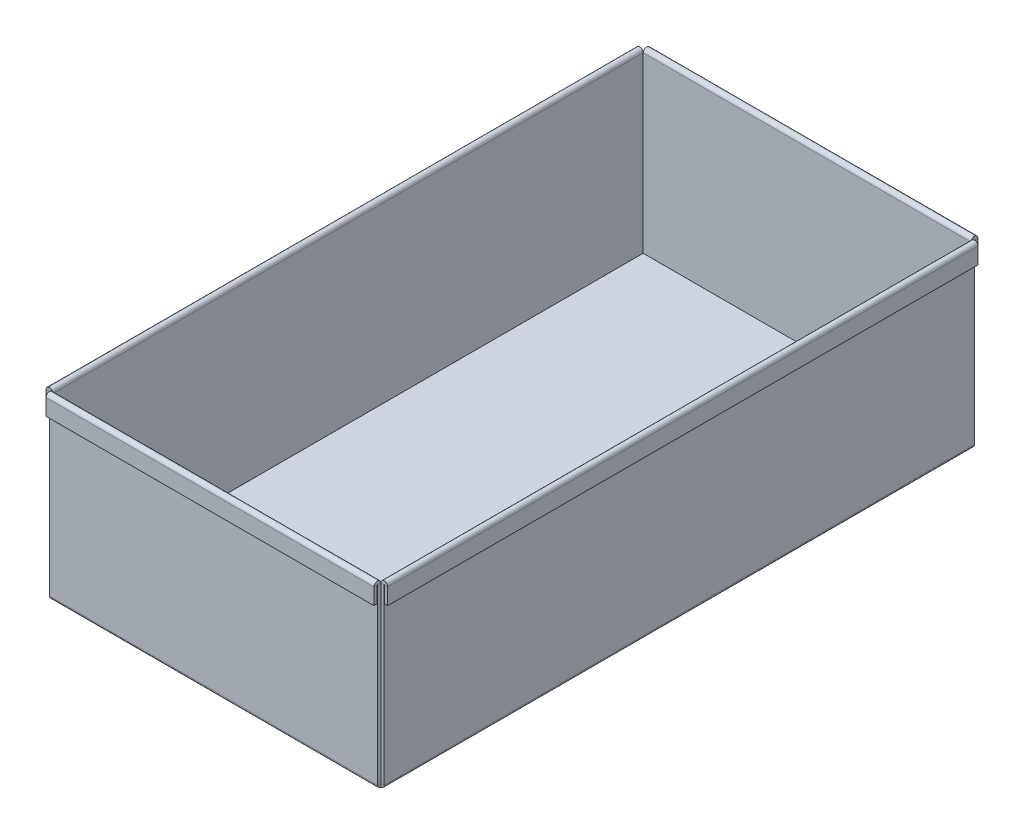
ISO-10303-21;
HEADER;
FILE_DESCRIPTION(('STEP AP214'),'2;1');
FILE_NAME('part.step','',(''),(''),'','','');
FILE_SCHEMA(('AUTOMOTIVE_DESIGN { 1 0 10303 214 1 1 1 1 }'));
ENDSEC;
DATA;
#1=APPLICATION_CONTEXT('core data for automotive mechanical design processes');
#2=APPLICATION_PROTOCOL_DEFINITION('international standard','automotive_design',2000,#1);
#3=PRODUCT_CONTEXT('',#1,'mechanical');
#4=PRODUCT('Part','Part','',(#3));
#5=PRODUCT_RELATED_PRODUCT_CATEGORY('part','',(#4));
#6=PRODUCT_DEFINITION_FORMATION('','',#4);
#7=PRODUCT_DEFINITION_CONTEXT('part definition',#1,'design');
#8=PRODUCT_DEFINITION('design','',#6,#7);
#9=PRODUCT_DEFINITION_SHAPE('','',#8);
#10=(LENGTH_UNIT() NAMED_UNIT(*) SI_UNIT(.MILLI.,.METRE.));
#11=(NAMED_UNIT(*) PLANE_ANGLE_UNIT() SI_UNIT($,.RADIAN.));
#12=(NAMED_UNIT(*) SI_UNIT($,.STERADIAN.) SOLID_ANGLE_UNIT());
#13=UNCERTAINTY_MEASURE_WITH_UNIT(LENGTH_MEASURE(1.E-05),#10,'distance_accuracy_value','');
#14=(GEOMETRIC_REPRESENTATION_CONTEXT(3) GLOBAL_UNCERTAINTY_ASSIGNED_CONTEXT((#13)) GLOBAL_UNIT_ASSIGNED_CONTEXT((#10,
#11,#12)) REPRESENTATION_CONTEXT('',''));
#15=CARTESIAN_POINT('',(0.,0.,0.));
#16=DIRECTION('',(0.,0.,1.));
#17=DIRECTION('',(1.,0.,0.));
#18=AXIS2_PLACEMENT_3D('',#15,#16,#17);
#19=CARTESIAN_POINT('',(-54.,1.,0.));
#20=DIRECTION('',(0.,-1.,0.));
#21=DIRECTION('',(0.,0.,-1.));
#22=AXIS2_PLACEMENT_3D('',#19,#20,#21);
#23=PLANE('',#22);
#24=DIRECTION('',(1.,0.,0.));
#25=VECTOR('',#24,1.);
#26=CARTESIAN_POINT('',(-54.,1.,-180.));
#27=LINE('',#26,#25);
#28=CARTESIAN_POINT('',(0.,1.,-180.));
#29=VERTEX_POINT('',#28);
#30=CARTESIAN_POINT('',(100.,1.,-180.));
#31=VERTEX_POINT('',#30);
#32=EDGE_CURVE('E654',#29,#31,#27,.T.);
#33=ORIENTED_EDGE('',*,*,#32,.F.);
#34=DIRECTION('',(0.,0.,1.));
#35=VECTOR('',#34,1.);
#36=CARTESIAN_POINT('',(0.,1.,0.));
#37=LINE('',#36,#35);
#38=CARTESIAN_POINT('',(0.,1.,-1.11022302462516E-13));
#39=VERTEX_POINT('',#38);
#40=EDGE_CURVE('E680',#29,#39,#37,.T.);
#41=ORIENTED_EDGE('',*,*,#40,.T.);
#42=DIRECTION('',(-1.,0.,0.));
#43=VECTOR('',#42,1.);
#44=CARTESIAN_POINT('',(-54.,1.,0.));
#45=LINE('',#44,#43);
#46=CARTESIAN_POINT('',(100.,1.,0.));
#47=VERTEX_POINT('',#46);
#48=EDGE_CURVE('E664',#47,#39,#45,.T.);
#49=ORIENTED_EDGE('',*,*,#48,.F.);
#50=DIRECTION('',(0.,0.,1.));
#51=VECTOR('',#50,1.);
#52=CARTESIAN_POINT('',(100.,1.,0.));
#53=LINE('',#52,#51);
#54=EDGE_CURVE('E670',#31,#47,#53,.T.);
#55=ORIENTED_EDGE('',*,*,#54,.F.);
#56=EDGE_LOOP('',(#33,#41,#49,#55));
#57=FACE_BOUND('',#56,.T.);
#58=ADVANCED_FACE('F60',(#57),#23,.F.);
#59=CARTESIAN_POINT('',(-54.,0.,0.));
#60=DIRECTION('',(0.,-1.,0.));
#61=DIRECTION('',(0.,0.,-1.));
#62=AXIS2_PLACEMENT_3D('',#59,#60,#61);
#63=PLANE('',#62);
#64=DIRECTION('',(0.,0.,1.));
#65=VECTOR('',#64,1.);
#66=CARTESIAN_POINT('',(0.,0.,0.));
#67=LINE('',#66,#65);
#68=CARTESIAN_POINT('',(0.,0.,-180.));
#69=VERTEX_POINT('',#68);
#70=CARTESIAN_POINT('',(0.,0.,0.));
#71=VERTEX_POINT('',#70);
#72=EDGE_CURVE('E68',#69,#71,#67,.T.);
#73=ORIENTED_EDGE('',*,*,#72,.F.);
#74=DIRECTION('',(1.,0.,0.));
#75=VECTOR('',#74,1.);
#76=CARTESIAN_POINT('',(-54.,0.,-180.));
#77=LINE('',#76,#75);
#78=CARTESIAN_POINT('',(100.,0.,-180.));
#79=VERTEX_POINT('',#78);
#80=EDGE_CURVE('E661',#69,#79,#77,.T.);
#81=ORIENTED_EDGE('',*,*,#80,.T.);
#82=DIRECTION('',(0.,0.,1.));
#83=VECTOR('',#82,1.);
#84=CARTESIAN_POINT('',(100.,0.,0.));
#85=LINE('',#84,#83);
#86=CARTESIAN_POINT('',(100.,0.,0.));
#87=VERTEX_POINT('',#86);
#88=EDGE_CURVE('E674',#79,#87,#85,.T.);
#89=ORIENTED_EDGE('',*,*,#88,.T.);
#90=DIRECTION('',(-1.,0.,0.));
#91=VECTOR('',#90,1.);
#92=CARTESIAN_POINT('',(-54.,0.,0.));
#93=LINE('',#92,#91);
#94=EDGE_CURVE('E667',#87,#71,#93,.T.);
#95=ORIENTED_EDGE('',*,*,#94,.T.);
#96=EDGE_LOOP('',(#73,#81,#89,#95));
#97=FACE_BOUND('',#96,.T.);
#98=ADVANCED_FACE('F62',(#97),#63,.T.);
#99=CARTESIAN_POINT('',(0.,1.001,-180.));
#100=DIRECTION('',(1.,0.,0.));
#101=DIRECTION('',(0.,0.,-1.));
#102=AXIS2_PLACEMENT_3D('',#99,#100,#101);
#103=PLANE('',#102);
#104=DIRECTION('',(0.,0.,1.));
#105=VECTOR('',#104,1.);
#106=CARTESIAN_POINT('',(0.,1.001,-180.001));
#107=LINE('',#106,#105);
#108=CARTESIAN_POINT('',(0.,1.001,-181.001));
#109=VERTEX_POINT('',#108);
#110=CARTESIAN_POINT('',(0.,1.00099999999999,-180.001));
#111=VERTEX_POINT('',#110);
#112=EDGE_CURVE('E295',#109,#111,#107,.T.);
#113=ORIENTED_EDGE('',*,*,#112,.F.);
#114=CARTESIAN_POINT('',(0.,1.001,-180.));
#115=DIRECTION('',(-1.,0.,0.));
#116=DIRECTION('',(0.,0.,1.));
#117=AXIS2_PLACEMENT_3D('',#114,#115,#116);
#118=CIRCLE('',#117,1.001);
#119=EDGE_CURVE('E634',#109,#69,#118,.T.);
#120=ORIENTED_EDGE('',*,*,#119,.T.);
#121=DIRECTION('',(0.,-1.,0.));
#122=VECTOR('',#121,1.);
#123=CARTESIAN_POINT('',(0.,1.,-180.));
#124=LINE('',#123,#122);
#125=EDGE_CURVE('E683',#29,#69,#124,.T.);
#126=ORIENTED_EDGE('',*,*,#125,.F.);
#127=CARTESIAN_POINT('',(0.,1.001,-180.));
#128=DIRECTION('',(-1.,0.,0.));
#129=DIRECTION('',(0.,0.,1.));
#130=AXIS2_PLACEMENT_3D('',#127,#128,#129);
#131=CIRCLE('',#130,0.00100000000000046);
#132=EDGE_CURVE('E647',#111,#29,#131,.T.);
#133=ORIENTED_EDGE('',*,*,#132,.F.);
#134=EDGE_LOOP('',(#113,#120,#126,#133));
#135=FACE_BOUND('',#134,.T.);
#136=ADVANCED_FACE('F731',(#135),#103,.F.);
#137=CARTESIAN_POINT('',(100.,1.001,-180.));
#138=DIRECTION('',(-1.,0.,0.));
#139=DIRECTION('',(0.,0.,1.));
#140=AXIS2_PLACEMENT_3D('',#137,#138,#139);
#141=PLANE('',#140);
#142=CARTESIAN_POINT('',(100.,1.001,-180.));
#143=DIRECTION('',(-1.,0.,0.));
#144=DIRECTION('',(0.,0.,1.));
#145=AXIS2_PLACEMENT_3D('',#142,#143,#144);
#146=CIRCLE('',#145,1.001);
#147=CARTESIAN_POINT('',(100.,1.001,-181.001));
#148=VERTEX_POINT('',#147);
#149=EDGE_CURVE('E651',#79,#148,#146,.F.);
#150=ORIENTED_EDGE('',*,*,#149,.T.);
#151=DIRECTION('',(0.,0.,-1.));
#152=VECTOR('',#151,1.);
#153=CARTESIAN_POINT('',(100.,1.001,-180.001));
#154=LINE('',#153,#152);
#155=CARTESIAN_POINT('',(100.,1.001,-180.001));
#156=VERTEX_POINT('',#155);
#157=EDGE_CURVE('E640',#156,#148,#154,.T.);
#158=ORIENTED_EDGE('',*,*,#157,.F.);
#159=CARTESIAN_POINT('',(100.,1.001,-180.));
#160=DIRECTION('',(1.,0.,0.));
#161=DIRECTION('',(0.,0.,-1.));
#162=AXIS2_PLACEMENT_3D('',#159,#160,#161);
#163=CIRCLE('',#162,0.00100000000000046);
#164=EDGE_CURVE('E650',#31,#156,#163,.T.);
#165=ORIENTED_EDGE('',*,*,#164,.F.);
#166=DIRECTION('',(0.,-1.,0.));
#167=VECTOR('',#166,1.);
#168=CARTESIAN_POINT('',(100.,1.,-180.));
#169=LINE('',#168,#167);
#170=EDGE_CURVE('E677',#31,#79,#169,.T.);
#171=ORIENTED_EDGE('',*,*,#170,.T.);
#172=EDGE_LOOP('',(#150,#158,#165,#171));
#173=FACE_BOUND('',#172,.T.);
#174=ADVANCED_FACE('F741',(#173),#141,.F.);
#175=CARTESIAN_POINT('',(150.004999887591,1.001,-180.));
#176=DIRECTION('',(-1.,0.,0.));
#177=DIRECTION('',(0.,0.,1.));
#178=AXIS2_PLACEMENT_3D('',#175,#176,#177);
#179=CYLINDRICAL_SURFACE('',#178,0.001);
#180=ORIENTED_EDGE('',*,*,#32,.T.);
#181=ORIENTED_EDGE('',*,*,#164,.T.);
#182=DIRECTION('',(1.,0.,0.));
#183=VECTOR('',#182,1.);
#184=CARTESIAN_POINT('',(-54.,1.001,-180.001));
#185=LINE('',#184,#183);
#186=EDGE_CURVE('E298',#111,#156,#185,.T.);
#187=ORIENTED_EDGE('',*,*,#186,.F.);
#188=ORIENTED_EDGE('',*,*,#132,.T.);
#189=EDGE_LOOP('',(#180,#181,#187,#188));
#190=FACE_BOUND('',#189,.T.);
#191=ADVANCED_FACE('F828',(#190),#179,.F.);
#192=CARTESIAN_POINT('',(150.004999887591,1.001,-180.));
#193=DIRECTION('',(-1.,0.,0.));
#194=DIRECTION('',(0.,0.,1.));
#195=AXIS2_PLACEMENT_3D('',#192,#193,#194);
#196=CYLINDRICAL_SURFACE('',#195,1.001);
#197=ORIENTED_EDGE('',*,*,#80,.F.);
#198=ORIENTED_EDGE('',*,*,#119,.F.);
#199=DIRECTION('',(1.,0.,0.));
#200=VECTOR('',#199,1.);
#201=CARTESIAN_POINT('',(-54.,1.001,-181.001));
#202=LINE('',#201,#200);
#203=EDGE_CURVE('E299',#109,#148,#202,.T.);
#204=ORIENTED_EDGE('',*,*,#203,.T.);
#205=ORIENTED_EDGE('',*,*,#149,.F.);
#206=EDGE_LOOP('',(#197,#198,#204,#205));
#207=FACE_BOUND('',#206,.T.);
#208=ADVANCED_FACE('F736',(#207),#196,.T.);
#209=CARTESIAN_POINT('',(-54.,-179.00058650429,-180.001000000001));
#210=DIRECTION('',(0.,0.,-1.));
#211=DIRECTION('',(0.,1.,0.));
#212=AXIS2_PLACEMENT_3D('',#209,#210,#211);
#213=PLANE('',#212);
#214=DIRECTION('',(0.,1.,0.));
#215=VECTOR('',#214,1.);
#216=CARTESIAN_POINT('',(100.,54.9994134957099,-180.001));
#217=LINE('',#216,#215);
#218=CARTESIAN_POINT('',(99.9999999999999,53.9494134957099,-180.001));
#219=VERTEX_POINT('',#218);
#220=EDGE_CURVE('E306',#156,#219,#217,.T.);
#221=ORIENTED_EDGE('',*,*,#220,.T.);
#222=DIRECTION('',(1.,0.,0.));
#223=VECTOR('',#222,1.);
#224=CARTESIAN_POINT('',(99.9999999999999,53.9494134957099,-180.001));
#225=LINE('',#224,#223);
#226=CARTESIAN_POINT('',(0.,53.9494134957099,-180.001));
#227=VERTEX_POINT('',#226);
#228=EDGE_CURVE('E303',#219,#227,#225,.F.);
#229=ORIENTED_EDGE('',*,*,#228,.T.);
#230=DIRECTION('',(0.,-1.,0.));
#231=VECTOR('',#230,1.);
#232=CARTESIAN_POINT('',(0.,0.99941349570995,-180.001));
#233=LINE('',#232,#231);
#234=EDGE_CURVE('E291',#227,#111,#233,.T.);
#235=ORIENTED_EDGE('',*,*,#234,.T.);
#236=ORIENTED_EDGE('',*,*,#186,.T.);
#237=EDGE_LOOP('',(#221,#229,#235,#236));
#238=FACE_BOUND('',#237,.T.);
#239=ADVANCED_FACE('F304',(#238),#213,.F.);
#240=CARTESIAN_POINT('',(100.,54.9994134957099,-180.001));
#241=DIRECTION('',(-1.,0.,0.));
#242=DIRECTION('',(0.,-1.,0.));
#243=AXIS2_PLACEMENT_3D('',#240,#241,#242);
#244=PLANE('',#243);
#245=DIRECTION('',(0.,1.,0.));
#246=VECTOR('',#245,1.);
#247=CARTESIAN_POINT('',(100.,54.9994134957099,-181.001));
#248=LINE('',#247,#246);
#249=CARTESIAN_POINT('',(99.9999999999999,53.9494134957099,-181.001));
#250=VERTEX_POINT('',#249);
#251=EDGE_CURVE('E637',#148,#250,#248,.T.);
#252=ORIENTED_EDGE('',*,*,#251,.T.);
#253=DIRECTION('',(0.,0.,1.));
#254=VECTOR('',#253,1.);
#255=CARTESIAN_POINT('',(99.9999999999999,53.9494134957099,-181.001));
#256=LINE('',#255,#254);
#257=EDGE_CURVE('E322',#250,#219,#256,.T.);
#258=ORIENTED_EDGE('',*,*,#257,.T.);
#259=ORIENTED_EDGE('',*,*,#220,.F.);
#260=ORIENTED_EDGE('',*,*,#157,.T.);
#261=EDGE_LOOP('',(#252,#258,#259,#260));
#262=FACE_BOUND('',#261,.T.);
#263=ADVANCED_FACE('F841',(#262),#244,.F.);
#264=CARTESIAN_POINT('',(-54.,-179.00058650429,-181.001000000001));
#265=DIRECTION('',(0.,0.,-1.));
#266=DIRECTION('',(0.,1.,0.));
#267=AXIS2_PLACEMENT_3D('',#264,#265,#266);
#268=PLANE('',#267);
#269=DIRECTION('',(1.,0.,0.));
#270=VECTOR('',#269,1.);
#271=CARTESIAN_POINT('',(99.9999999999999,53.9494134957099,-181.001));
#272=LINE('',#271,#270);
#273=CARTESIAN_POINT('',(0.,53.9494134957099,-181.001));
#274=VERTEX_POINT('',#273);
#275=EDGE_CURVE('E332',#250,#274,#272,.F.);
#276=ORIENTED_EDGE('',*,*,#275,.F.);
#277=ORIENTED_EDGE('',*,*,#251,.F.);
#278=ORIENTED_EDGE('',*,*,#203,.F.);
#279=DIRECTION('',(0.,-1.,0.));
#280=VECTOR('',#279,1.);
#281=CARTESIAN_POINT('',(0.,0.99941349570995,-181.001));
#282=LINE('',#281,#280);
#283=EDGE_CURVE('E635',#274,#109,#282,.T.);
#284=ORIENTED_EDGE('',*,*,#283,.F.);
#285=EDGE_LOOP('',(#276,#277,#278,#284));
#286=FACE_BOUND('',#285,.T.);
#287=ADVANCED_FACE('F838',(#286),#268,.T.);
#288=CARTESIAN_POINT('',(0.,0.99941349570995,-180.001));
#289=DIRECTION('',(1.,0.,0.));
#290=DIRECTION('',(0.,1.,0.));
#291=AXIS2_PLACEMENT_3D('',#288,#289,#290);
#292=PLANE('',#291);
#293=ORIENTED_EDGE('',*,*,#234,.F.);
#294=DIRECTION('',(0.,0.,1.));
#295=VECTOR('',#294,1.);
#296=CARTESIAN_POINT('',(0.,53.9494134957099,-181.001));
#297=LINE('',#296,#295);
#298=EDGE_CURVE('E75',#274,#227,#297,.T.);
#299=ORIENTED_EDGE('',*,*,#298,.F.);
#300=ORIENTED_EDGE('',*,*,#283,.T.);
#301=ORIENTED_EDGE('',*,*,#112,.T.);
#302=EDGE_LOOP('',(#293,#299,#300,#301));
#303=FACE_BOUND('',#302,.T.);
#304=ADVANCED_FACE('F293',(#303),#292,.F.);
#305=CARTESIAN_POINT('',(100.,1.001,0.));
#306=DIRECTION('',(-1.,0.,0.));
#307=DIRECTION('',(0.,0.,1.));
#308=AXIS2_PLACEMENT_3D('',#305,#306,#307);
#309=PLANE('',#308);
#310=DIRECTION('',(0.,0.,-1.));
#311=VECTOR('',#310,1.);
#312=CARTESIAN_POINT('',(100.,1.001,0.00100000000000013));
#313=LINE('',#312,#311);
#314=CARTESIAN_POINT('',(100.,1.001,1.001));
#315=VERTEX_POINT('',#314);
#316=CARTESIAN_POINT('',(100.,1.001,0.001));
#317=VERTEX_POINT('',#316);
#318=EDGE_CURVE('E601',#315,#317,#313,.T.);
#319=ORIENTED_EDGE('',*,*,#318,.F.);
#320=CARTESIAN_POINT('',(100.,1.001,0.));
#321=DIRECTION('',(1.,0.,0.));
#322=DIRECTION('',(0.,0.,-1.));
#323=AXIS2_PLACEMENT_3D('',#320,#321,#322);
#324=CIRCLE('',#323,1.001);
#325=EDGE_CURVE('E604',#315,#87,#324,.T.);
#326=ORIENTED_EDGE('',*,*,#325,.T.);
#327=DIRECTION('',(0.,-1.,0.));
#328=VECTOR('',#327,1.);
#329=CARTESIAN_POINT('',(100.,1.,0.));
#330=LINE('',#329,#328);
#331=EDGE_CURVE('E672',#47,#87,#330,.T.);
#332=ORIENTED_EDGE('',*,*,#331,.F.);
#333=CARTESIAN_POINT('',(100.,1.001,0.));
#334=DIRECTION('',(1.,0.,0.));
#335=DIRECTION('',(0.,0.,-1.));
#336=AXIS2_PLACEMENT_3D('',#333,#334,#335);
#337=CIRCLE('',#336,0.000999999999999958);
#338=EDGE_CURVE('E622',#317,#47,#337,.T.);
#339=ORIENTED_EDGE('',*,*,#338,.F.);
#340=EDGE_LOOP('',(#319,#326,#332,#339));
#341=FACE_BOUND('',#340,.T.);
#342=ADVANCED_FACE('F767',(#341),#309,.F.);
#343=CARTESIAN_POINT('',(0.,1.001,0.));
#344=DIRECTION('',(1.,0.,0.));
#345=DIRECTION('',(0.,0.,-1.));
#346=AXIS2_PLACEMENT_3D('',#343,#344,#345);
#347=PLANE('',#346);
#348=CARTESIAN_POINT('',(0.,1.001,0.));
#349=DIRECTION('',(1.,0.,0.));
#350=DIRECTION('',(0.,0.,-1.));
#351=AXIS2_PLACEMENT_3D('',#348,#349,#350);
#352=CIRCLE('',#351,1.001);
#353=CARTESIAN_POINT('',(0.,1.00100000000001,1.001));
#354=VERTEX_POINT('',#353);
#355=EDGE_CURVE('E626',#71,#354,#352,.F.);
#356=ORIENTED_EDGE('',*,*,#355,.T.);
#357=DIRECTION('',(0.,0.,1.));
#358=VECTOR('',#357,1.);
#359=CARTESIAN_POINT('',(0.,1.001,0.00100000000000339));
#360=LINE('',#359,#358);
#361=CARTESIAN_POINT('',(0.,1.001,0.00100000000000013));
#362=VERTEX_POINT('',#361);
#363=EDGE_CURVE('E610',#362,#354,#360,.T.);
#364=ORIENTED_EDGE('',*,*,#363,.F.);
#365=CARTESIAN_POINT('',(0.,1.001,0.));
#366=DIRECTION('',(-1.,0.,0.));
#367=DIRECTION('',(0.,0.,1.));
#368=AXIS2_PLACEMENT_3D('',#365,#366,#367);
#369=CIRCLE('',#368,0.000999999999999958);
#370=EDGE_CURVE('E625',#39,#362,#369,.T.);
#371=ORIENTED_EDGE('',*,*,#370,.F.);
#372=DIRECTION('',(0.,-1.,0.));
#373=VECTOR('',#372,1.);
#374=CARTESIAN_POINT('',(0.,1.,0.));
#375=LINE('',#374,#373);
#376=EDGE_CURVE('E14',#39,#71,#375,.T.);
#377=ORIENTED_EDGE('',*,*,#376,.T.);
#378=EDGE_LOOP('',(#356,#364,#371,#377));
#379=FACE_BOUND('',#378,.T.);
#380=ADVANCED_FACE('F705',(#379),#347,.F.);
#381=CARTESIAN_POINT('',(-50.0049998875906,1.001,0.));
#382=DIRECTION('',(1.,0.,0.));
#383=DIRECTION('',(0.,0.,-1.));
#384=AXIS2_PLACEMENT_3D('',#381,#382,#383);
#385=CYLINDRICAL_SURFACE('',#384,0.001);
#386=ORIENTED_EDGE('',*,*,#48,.T.);
#387=ORIENTED_EDGE('',*,*,#370,.T.);
#388=DIRECTION('',(-1.,0.,0.));
#389=VECTOR('',#388,1.);
#390=CARTESIAN_POINT('',(-54.,1.001,0.00100000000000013));
#391=LINE('',#390,#389);
#392=EDGE_CURVE('E616',#317,#362,#391,.T.);
#393=ORIENTED_EDGE('',*,*,#392,.F.);
#394=ORIENTED_EDGE('',*,*,#338,.T.);
#395=EDGE_LOOP('',(#386,#387,#393,#394));
#396=FACE_BOUND('',#395,.T.);
#397=ADVANCED_FACE('F708',(#396),#385,.F.);
#398=CARTESIAN_POINT('',(-50.0049998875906,1.001,0.));
#399=DIRECTION('',(1.,0.,0.));
#400=DIRECTION('',(0.,0.,-1.));
#401=AXIS2_PLACEMENT_3D('',#398,#399,#400);
#402=CYLINDRICAL_SURFACE('',#401,1.001);
#403=ORIENTED_EDGE('',*,*,#94,.F.);
#404=ORIENTED_EDGE('',*,*,#325,.F.);
#405=DIRECTION('',(-1.,0.,0.));
#406=VECTOR('',#405,1.);
#407=CARTESIAN_POINT('',(-54.,1.001,1.001));
#408=LINE('',#407,#406);
#409=EDGE_CURVE('E597',#315,#354,#408,.T.);
#410=ORIENTED_EDGE('',*,*,#409,.T.);
#411=ORIENTED_EDGE('',*,*,#355,.F.);
#412=EDGE_LOOP('',(#403,#404,#410,#411));
#413=FACE_BOUND('',#412,.T.);
#414=ADVANCED_FACE('F700',(#413),#402,.T.);
#415=CARTESIAN_POINT('',(-54.,0.999413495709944,0.00100000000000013));
#416=DIRECTION('',(0.,0.,1.));
#417=DIRECTION('',(0.,-1.,0.));
#418=AXIS2_PLACEMENT_3D('',#415,#416,#417);
#419=PLANE('',#418);
#420=DIRECTION('',(0.,1.,0.));
#421=VECTOR('',#420,1.);
#422=CARTESIAN_POINT('',(0.,54.9994134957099,0.000999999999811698));
#423=LINE('',#422,#421);
#424=CARTESIAN_POINT('',(0.,53.9494134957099,0.000999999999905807));
#425=VERTEX_POINT('',#424);
#426=EDGE_CURVE('E613',#362,#425,#423,.T.);
#427=ORIENTED_EDGE('',*,*,#426,.T.);
#428=DIRECTION('',(-1.,0.,0.));
#429=VECTOR('',#428,1.);
#430=CARTESIAN_POINT('',(0.,53.9494134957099,0.000999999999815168));
#431=LINE('',#430,#429);
#432=CARTESIAN_POINT('',(100.,53.9494134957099,0.000999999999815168));
#433=VERTEX_POINT('',#432);
#434=EDGE_CURVE('E423',#425,#433,#431,.F.);
#435=ORIENTED_EDGE('',*,*,#434,.T.);
#436=DIRECTION('',(0.,-1.,0.));
#437=VECTOR('',#436,1.);
#438=CARTESIAN_POINT('',(100.,0.999413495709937,0.00100000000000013));
#439=LINE('',#438,#437);
#440=EDGE_CURVE('E618',#433,#317,#439,.T.);
#441=ORIENTED_EDGE('',*,*,#440,.T.);
#442=ORIENTED_EDGE('',*,*,#392,.T.);
#443=EDGE_LOOP('',(#427,#435,#441,#442));
#444=FACE_BOUND('',#443,.T.);
#445=ADVANCED_FACE('F779',(#444),#419,.F.);
#446=CARTESIAN_POINT('',(0.,54.9994134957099,0.000999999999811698));
#447=DIRECTION('',(1.,0.,0.));
#448=DIRECTION('',(0.,-1.,0.));
#449=AXIS2_PLACEMENT_3D('',#446,#447,#448);
#450=PLANE('',#449);
#451=DIRECTION('',(0.,1.,0.));
#452=VECTOR('',#451,1.);
#453=CARTESIAN_POINT('',(0.,54.9994134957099,1.00099999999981));
#454=LINE('',#453,#452);
#455=CARTESIAN_POINT('',(0.,53.9494134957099,1.00099999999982));
#456=VERTEX_POINT('',#455);
#457=EDGE_CURVE('E607',#354,#456,#454,.T.);
#458=ORIENTED_EDGE('',*,*,#457,.T.);
#459=DIRECTION('',(0.,0.,-1.));
#460=VECTOR('',#459,1.);
#461=CARTESIAN_POINT('',(0.,53.9494134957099,1.00099999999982));
#462=LINE('',#461,#460);
#463=EDGE_CURVE('E430',#456,#425,#462,.T.);
#464=ORIENTED_EDGE('',*,*,#463,.T.);
#465=ORIENTED_EDGE('',*,*,#426,.F.);
#466=ORIENTED_EDGE('',*,*,#363,.T.);
#467=EDGE_LOOP('',(#458,#464,#465,#466));
#468=FACE_BOUND('',#467,.T.);
#469=ADVANCED_FACE('F776',(#468),#450,.F.);
#470=CARTESIAN_POINT('',(-54.,0.999413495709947,1.001));
#471=DIRECTION('',(0.,0.,1.));
#472=DIRECTION('',(0.,-1.,0.));
#473=AXIS2_PLACEMENT_3D('',#470,#471,#472);
#474=PLANE('',#473);
#475=DIRECTION('',(-1.,0.,0.));
#476=VECTOR('',#475,1.);
#477=CARTESIAN_POINT('',(0.,53.9494134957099,1.00099999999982));
#478=LINE('',#477,#476);
#479=CARTESIAN_POINT('',(100.,53.9494134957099,1.00099999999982));
#480=VERTEX_POINT('',#479);
#481=EDGE_CURVE('E436',#456,#480,#478,.F.);
#482=ORIENTED_EDGE('',*,*,#481,.F.);
#483=ORIENTED_EDGE('',*,*,#457,.F.);
#484=ORIENTED_EDGE('',*,*,#409,.F.);
#485=DIRECTION('',(0.,-1.,0.));
#486=VECTOR('',#485,1.);
#487=CARTESIAN_POINT('',(100.,0.999413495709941,1.001));
#488=LINE('',#487,#486);
#489=EDGE_CURVE('E605',#480,#315,#488,.T.);
#490=ORIENTED_EDGE('',*,*,#489,.F.);
#491=EDGE_LOOP('',(#482,#483,#484,#490));
#492=FACE_BOUND('',#491,.T.);
#493=ADVANCED_FACE('F772',(#492),#474,.T.);
#494=CARTESIAN_POINT('',(100.,0.999413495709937,0.00100000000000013));
#495=DIRECTION('',(-1.,0.,0.));
#496=DIRECTION('',(0.,1.,0.));
#497=AXIS2_PLACEMENT_3D('',#494,#495,#496);
#498=PLANE('',#497);
#499=ORIENTED_EDGE('',*,*,#440,.F.);
#500=DIRECTION('',(0.,0.,-1.));
#501=VECTOR('',#500,1.);
#502=CARTESIAN_POINT('',(100.,53.9494134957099,1.00099999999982));
#503=LINE('',#502,#501);
#504=EDGE_CURVE('E441',#480,#433,#503,.T.);
#505=ORIENTED_EDGE('',*,*,#504,.F.);
#506=ORIENTED_EDGE('',*,*,#489,.T.);
#507=ORIENTED_EDGE('',*,*,#318,.T.);
#508=EDGE_LOOP('',(#499,#505,#506,#507));
#509=FACE_BOUND('',#508,.T.);
#510=ADVANCED_FACE('F769',(#509),#498,.F.);
#511=CARTESIAN_POINT('',(100.,1.001,-180.));
#512=DIRECTION('',(0.,0.,1.));
#513=DIRECTION('',(1.,0.,0.));
#514=AXIS2_PLACEMENT_3D('',#511,#512,#513);
#515=PLANE('',#514);
#516=DIRECTION('',(-1.,0.,0.));
#517=VECTOR('',#516,1.);
#518=CARTESIAN_POINT('',(100.001,1.001,-180.));
#519=LINE('',#518,#517);
#520=CARTESIAN_POINT('',(101.001,1.001,-180.));
#521=VERTEX_POINT('',#520);
#522=CARTESIAN_POINT('',(100.001,1.001,-180.));
#523=VERTEX_POINT('',#522);
#524=EDGE_CURVE('E569',#521,#523,#519,.T.);
#525=ORIENTED_EDGE('',*,*,#524,.F.);
#526=CARTESIAN_POINT('',(100.,1.001,-180.));
#527=DIRECTION('',(0.,0.,-1.));
#528=DIRECTION('',(-1.,0.,0.));
#529=AXIS2_PLACEMENT_3D('',#526,#527,#528);
#530=CIRCLE('',#529,1.001);
#531=EDGE_CURVE('E572',#521,#79,#530,.T.);
#532=ORIENTED_EDGE('',*,*,#531,.T.);
#533=ORIENTED_EDGE('',*,*,#170,.F.);
#534=CARTESIAN_POINT('',(100.,1.001,-180.));
#535=DIRECTION('',(0.,0.,-1.));
#536=DIRECTION('',(-1.,0.,0.));
#537=AXIS2_PLACEMENT_3D('',#534,#535,#536);
#538=CIRCLE('',#537,0.00100000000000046);
#539=EDGE_CURVE('E590',#523,#31,#538,.T.);
#540=ORIENTED_EDGE('',*,*,#539,.F.);
#541=EDGE_LOOP('',(#525,#532,#533,#540));
#542=FACE_BOUND('',#541,.T.);
#543=ADVANCED_FACE('F745',(#542),#515,.F.);
#544=CARTESIAN_POINT('',(100.,1.001,0.));
#545=DIRECTION('',(0.,0.,-1.));
#546=DIRECTION('',(-1.,0.,0.));
#547=AXIS2_PLACEMENT_3D('',#544,#545,#546);
#548=PLANE('',#547);
#549=CARTESIAN_POINT('',(100.,1.001,0.));
#550=DIRECTION('',(0.,0.,-1.));
#551=DIRECTION('',(-1.,0.,0.));
#552=AXIS2_PLACEMENT_3D('',#549,#550,#551);
#553=CIRCLE('',#552,1.001);
#554=CARTESIAN_POINT('',(101.001,1.001,0.));
#555=VERTEX_POINT('',#554);
#556=EDGE_CURVE('E594',#87,#555,#553,.F.);
#557=ORIENTED_EDGE('',*,*,#556,.T.);
#558=DIRECTION('',(1.,0.,0.));
#559=VECTOR('',#558,1.);
#560=CARTESIAN_POINT('',(100.001,1.001,0.));
#561=LINE('',#560,#559);
#562=CARTESIAN_POINT('',(100.001,1.001,0.));
#563=VERTEX_POINT('',#562);
#564=EDGE_CURVE('E578',#563,#555,#561,.T.);
#565=ORIENTED_EDGE('',*,*,#564,.F.);
#566=CARTESIAN_POINT('',(100.,1.001,0.));
#567=DIRECTION('',(0.,0.,1.));
#568=DIRECTION('',(1.,0.,0.));
#569=AXIS2_PLACEMENT_3D('',#566,#567,#568);
#570=CIRCLE('',#569,0.00100000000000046);
#571=EDGE_CURVE('E593',#47,#563,#570,.T.);
#572=ORIENTED_EDGE('',*,*,#571,.F.);
#573=ORIENTED_EDGE('',*,*,#331,.T.);
#574=EDGE_LOOP('',(#557,#565,#572,#573));
#575=FACE_BOUND('',#574,.T.);
#576=ADVANCED_FACE('F760',(#575),#548,.F.);
#577=CARTESIAN_POINT('',(100.,1.001,90.0027777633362));
#578=DIRECTION('',(0.,0.,-1.));
#579=DIRECTION('',(-1.,0.,0.));
#580=AXIS2_PLACEMENT_3D('',#577,#578,#579);
#581=CYLINDRICAL_SURFACE('',#580,0.001);
#582=ORIENTED_EDGE('',*,*,#54,.T.);
#583=ORIENTED_EDGE('',*,*,#571,.T.);
#584=DIRECTION('',(0.,0.,1.));
#585=VECTOR('',#584,1.);
#586=CARTESIAN_POINT('',(100.001,1.00099999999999,0.));
#587=LINE('',#586,#585);
#588=EDGE_CURVE('E584',#523,#563,#587,.T.);
#589=ORIENTED_EDGE('',*,*,#588,.F.);
#590=ORIENTED_EDGE('',*,*,#539,.T.);
#591=EDGE_LOOP('',(#582,#583,#589,#590));
#592=FACE_BOUND('',#591,.T.);
#593=ADVANCED_FACE('F749',(#592),#581,.F.);
#594=CARTESIAN_POINT('',(100.,1.001,90.0027777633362));
#595=DIRECTION('',(0.,0.,-1.));
#596=DIRECTION('',(-1.,0.,0.));
#597=AXIS2_PLACEMENT_3D('',#594,#595,#596);
#598=CYLINDRICAL_SURFACE('',#597,1.001);
#599=ORIENTED_EDGE('',*,*,#88,.F.);
#600=ORIENTED_EDGE('',*,*,#531,.F.);
#601=DIRECTION('',(0.,0.,1.));
#602=VECTOR('',#601,1.);
#603=CARTESIAN_POINT('',(101.001,1.00099999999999,0.));
#604=LINE('',#603,#602);
#605=EDGE_CURVE('E564',#521,#555,#604,.T.);
#606=ORIENTED_EDGE('',*,*,#605,.T.);
#607=ORIENTED_EDGE('',*,*,#556,.F.);
#608=EDGE_LOOP('',(#599,#600,#606,#607));
#609=FACE_BOUND('',#608,.T.);
#610=ADVANCED_FACE('F763',(#609),#598,.T.);
#611=CARTESIAN_POINT('',(100.001000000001,-153.00058650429,0.));
#612=DIRECTION('',(1.,0.,0.));
#613=DIRECTION('',(0.,0.,-1.));
#614=AXIS2_PLACEMENT_3D('',#611,#612,#613);
#615=PLANE('',#614);
#616=DIRECTION('',(0.,1.,0.));
#617=VECTOR('',#616,1.);
#618=CARTESIAN_POINT('',(100.001,54.9994134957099,0.));
#619=LINE('',#618,#617);
#620=CARTESIAN_POINT('',(100.001,53.9494134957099,0.));
#621=VERTEX_POINT('',#620);
#622=EDGE_CURVE('E581',#563,#621,#619,.T.);
#623=ORIENTED_EDGE('',*,*,#622,.T.);
#624=DIRECTION('',(0.,0.,1.));
#625=VECTOR('',#624,1.);
#626=CARTESIAN_POINT('',(100.001,53.9494134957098,0.));
#627=LINE('',#626,#625);
#628=CARTESIAN_POINT('',(100.001,53.9494134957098,-180.));
#629=VERTEX_POINT('',#628);
#630=EDGE_CURVE('E479',#621,#629,#627,.F.);
#631=ORIENTED_EDGE('',*,*,#630,.T.);
#632=DIRECTION('',(0.,-1.,0.));
#633=VECTOR('',#632,1.);
#634=CARTESIAN_POINT('',(100.001,0.999413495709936,-180.));
#635=LINE('',#634,#633);
#636=EDGE_CURVE('E586',#629,#523,#635,.T.);
#637=ORIENTED_EDGE('',*,*,#636,.T.);
#638=ORIENTED_EDGE('',*,*,#588,.T.);
#639=EDGE_LOOP('',(#623,#631,#637,#638));
#640=FACE_BOUND('',#639,.T.);
#641=ADVANCED_FACE('F753',(#640),#615,.F.);
#642=CARTESIAN_POINT('',(100.001,54.9994134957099,0.));
#643=DIRECTION('',(0.,0.,-1.));
#644=DIRECTION('',(0.,-1.,0.));
#645=AXIS2_PLACEMENT_3D('',#642,#643,#644);
#646=PLANE('',#645);
#647=DIRECTION('',(0.,1.,0.));
#648=VECTOR('',#647,1.);
#649=CARTESIAN_POINT('',(101.001,54.9994134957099,0.));
#650=LINE('',#649,#648);
#651=CARTESIAN_POINT('',(101.001,53.9494134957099,0.));
#652=VERTEX_POINT('',#651);
#653=EDGE_CURVE('E575',#555,#652,#650,.T.);
#654=ORIENTED_EDGE('',*,*,#653,.T.);
#655=DIRECTION('',(-1.,-1.3877787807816E-13,0.));
#656=VECTOR('',#655,1.);
#657=CARTESIAN_POINT('',(101.001,53.9494134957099,0.));
#658=LINE('',#657,#656);
#659=EDGE_CURVE('E486',#652,#621,#658,.T.);
#660=ORIENTED_EDGE('',*,*,#659,.T.);
#661=ORIENTED_EDGE('',*,*,#622,.F.);
#662=ORIENTED_EDGE('',*,*,#564,.T.);
#663=EDGE_LOOP('',(#654,#660,#661,#662));
#664=FACE_BOUND('',#663,.T.);
#665=ADVANCED_FACE('F757',(#664),#646,.F.);
#666=CARTESIAN_POINT('',(101.001000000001,-153.00058650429,0.));
#667=DIRECTION('',(1.,0.,0.));
#668=DIRECTION('',(0.,0.,-1.));
#669=AXIS2_PLACEMENT_3D('',#666,#667,#668);
#670=PLANE('',#669);
#671=DIRECTION('',(0.,0.,1.));
#672=VECTOR('',#671,1.);
#673=CARTESIAN_POINT('',(101.001,53.9494134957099,0.));
#674=LINE('',#673,#672);
#675=CARTESIAN_POINT('',(101.001,53.9494134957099,-180.));
#676=VERTEX_POINT('',#675);
#677=EDGE_CURVE('E492',#652,#676,#674,.F.);
#678=ORIENTED_EDGE('',*,*,#677,.F.);
#679=ORIENTED_EDGE('',*,*,#653,.F.);
#680=ORIENTED_EDGE('',*,*,#605,.F.);
#681=DIRECTION('',(0.,-1.,0.));
#682=VECTOR('',#681,1.);
#683=CARTESIAN_POINT('',(101.001,0.999413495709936,-180.));
#684=LINE('',#683,#682);
#685=EDGE_CURVE('E573',#676,#521,#684,.T.);
#686=ORIENTED_EDGE('',*,*,#685,.F.);
#687=EDGE_LOOP('',(#678,#679,#680,#686));
#688=FACE_BOUND('',#687,.T.);
#689=ADVANCED_FACE('F875',(#688),#670,.T.);
#690=CARTESIAN_POINT('',(100.001,0.999413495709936,-180.));
#691=DIRECTION('',(0.,0.,1.));
#692=DIRECTION('',(0.,1.,0.));
#693=AXIS2_PLACEMENT_3D('',#690,#691,#692);
#694=PLANE('',#693);
#695=ORIENTED_EDGE('',*,*,#636,.F.);
#696=DIRECTION('',(-1.,-1.38777878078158E-13,0.));
#697=VECTOR('',#696,1.);
#698=CARTESIAN_POINT('',(101.001,53.9494134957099,-180.));
#699=LINE('',#698,#697);
#700=EDGE_CURVE('E497',#676,#629,#699,.T.);
#701=ORIENTED_EDGE('',*,*,#700,.F.);
#702=ORIENTED_EDGE('',*,*,#685,.T.);
#703=ORIENTED_EDGE('',*,*,#524,.T.);
#704=EDGE_LOOP('',(#695,#701,#702,#703));
#705=FACE_BOUND('',#704,.T.);
#706=ADVANCED_FACE('F872',(#705),#694,.F.);
#707=CARTESIAN_POINT('',(0.,1.001,-180.));
#708=DIRECTION('',(0.,0.,1.));
#709=DIRECTION('',(1.,0.,0.));
#710=AXIS2_PLACEMENT_3D('',#707,#708,#709);
#711=PLANE('',#710);
#712=ORIENTED_EDGE('',*,*,#125,.T.);
#713=CARTESIAN_POINT('',(0.,1.001,-180.));
#714=DIRECTION('',(0.,0.,1.));
#715=DIRECTION('',(1.,0.,0.));
#716=AXIS2_PLACEMENT_3D('',#713,#714,#715);
#717=CIRCLE('',#716,1.001);
#718=CARTESIAN_POINT('',(-1.001,1.001,-180.));
#719=VERTEX_POINT('',#718);
#720=EDGE_CURVE('E537',#69,#719,#717,.F.);
#721=ORIENTED_EDGE('',*,*,#720,.T.);
#722=DIRECTION('',(1.,0.,0.));
#723=VECTOR('',#722,1.);
#724=CARTESIAN_POINT('',(-0.00100000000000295,1.001,-180.));
#725=LINE('',#724,#723);
#726=CARTESIAN_POINT('',(-0.00100000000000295,1.001,-180.));
#727=VERTEX_POINT('',#726);
#728=EDGE_CURVE('E549',#719,#727,#725,.T.);
#729=ORIENTED_EDGE('',*,*,#728,.T.);
#730=CARTESIAN_POINT('',(0.,1.001,-180.));
#731=DIRECTION('',(0.,0.,-1.));
#732=DIRECTION('',(-1.,0.,0.));
#733=AXIS2_PLACEMENT_3D('',#730,#731,#732);
#734=CIRCLE('',#733,0.000999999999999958);
#735=EDGE_CURVE('E557',#29,#727,#734,.T.);
#736=ORIENTED_EDGE('',*,*,#735,.F.);
#737=EDGE_LOOP('',(#712,#721,#729,#736));
#738=FACE_BOUND('',#737,.T.);
#739=ADVANCED_FACE('F727',(#738),#711,.F.);
#740=CARTESIAN_POINT('',(0.,1.001,-1.11022302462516E-13));
#741=DIRECTION('',(0.,0.,-1.));
#742=DIRECTION('',(-1.,0.,0.));
#743=AXIS2_PLACEMENT_3D('',#740,#741,#742);
#744=PLANE('',#743);
#745=DIRECTION('',(-1.,0.,0.));
#746=VECTOR('',#745,1.);
#747=CARTESIAN_POINT('',(-0.00100000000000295,1.001,0.));
#748=LINE('',#747,#746);
#749=CARTESIAN_POINT('',(-0.001,1.001,-1.66533453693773E-13));
#750=VERTEX_POINT('',#749);
#751=CARTESIAN_POINT('',(-1.001,1.001,0.));
#752=VERTEX_POINT('',#751);
#753=EDGE_CURVE('E552',#750,#752,#748,.T.);
#754=ORIENTED_EDGE('',*,*,#753,.T.);
#755=CARTESIAN_POINT('',(0.,1.001,-2.77555756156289E-13));
#756=DIRECTION('',(0.,0.,1.));
#757=DIRECTION('',(1.,0.,0.));
#758=AXIS2_PLACEMENT_3D('',#755,#756,#757);
#759=CIRCLE('',#758,1.001);
#760=EDGE_CURVE('E561',#752,#71,#759,.T.);
#761=ORIENTED_EDGE('',*,*,#760,.T.);
#762=ORIENTED_EDGE('',*,*,#376,.F.);
#763=CARTESIAN_POINT('',(0.,1.001,-1.11022302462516E-13));
#764=DIRECTION('',(0.,0.,1.));
#765=DIRECTION('',(1.,0.,0.));
#766=AXIS2_PLACEMENT_3D('',#763,#764,#765);
#767=CIRCLE('',#766,0.000999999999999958);
#768=EDGE_CURVE('E560',#750,#39,#767,.T.);
#769=ORIENTED_EDGE('',*,*,#768,.F.);
#770=EDGE_LOOP('',(#754,#761,#762,#769));
#771=FACE_BOUND('',#770,.T.);
#772=ADVANCED_FACE('F692',(#771),#744,.F.);
#773=CARTESIAN_POINT('',(0.,1.001,-270.002777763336));
#774=DIRECTION('',(0.,0.,1.));
#775=DIRECTION('',(1.,0.,0.));
#776=AXIS2_PLACEMENT_3D('',#773,#774,#775);
#777=CYLINDRICAL_SURFACE('',#776,0.001);
#778=ORIENTED_EDGE('',*,*,#768,.T.);
#779=ORIENTED_EDGE('',*,*,#40,.F.);
#780=ORIENTED_EDGE('',*,*,#735,.T.);
#781=DIRECTION('',(0.,0.,1.));
#782=VECTOR('',#781,1.);
#783=CARTESIAN_POINT('',(-0.00100000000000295,1.001,0.));
#784=LINE('',#783,#782);
#785=EDGE_CURVE('E533',#727,#750,#784,.T.);
#786=ORIENTED_EDGE('',*,*,#785,.T.);
#787=EDGE_LOOP('',(#778,#779,#780,#786));
#788=FACE_BOUND('',#787,.T.);
#789=ADVANCED_FACE('F717',(#788),#777,.F.);
#790=CARTESIAN_POINT('',(0.,1.001,-270.002777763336));
#791=DIRECTION('',(0.,0.,1.));
#792=DIRECTION('',(1.,0.,0.));
#793=AXIS2_PLACEMENT_3D('',#790,#791,#792);
#794=CYLINDRICAL_SURFACE('',#793,1.001);
#795=ORIENTED_EDGE('',*,*,#760,.F.);
#796=DIRECTION('',(0.,0.,1.));
#797=VECTOR('',#796,1.);
#798=CARTESIAN_POINT('',(-1.001,1.001,0.));
#799=LINE('',#798,#797);
#800=EDGE_CURVE('E538',#719,#752,#799,.T.);
#801=ORIENTED_EDGE('',*,*,#800,.F.);
#802=ORIENTED_EDGE('',*,*,#720,.F.);
#803=ORIENTED_EDGE('',*,*,#72,.T.);
#804=EDGE_LOOP('',(#795,#801,#802,#803));
#805=FACE_BOUND('',#804,.T.);
#806=ADVANCED_FACE('F688',(#805),#794,.T.);
#807=CARTESIAN_POINT('',(-0.000999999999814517,54.9994134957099,0.));
#808=DIRECTION('',(-1.,0.,0.));
#809=DIRECTION('',(0.,0.,-1.));
#810=AXIS2_PLACEMENT_3D('',#807,#808,#809);
#811=PLANE('',#810);
#812=DIRECTION('',(0.,1.,0.));
#813=VECTOR('',#812,1.);
#814=CARTESIAN_POINT('',(-0.000999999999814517,54.9994134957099,-180.));
#815=LINE('',#814,#813);
#816=CARTESIAN_POINT('',(-0.000999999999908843,53.9494134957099,-180.));
#817=VERTEX_POINT('',#816);
#818=EDGE_CURVE('E546',#727,#817,#815,.T.);
#819=ORIENTED_EDGE('',*,*,#818,.T.);
#820=DIRECTION('',(0.,0.,-1.));
#821=VECTOR('',#820,1.);
#822=CARTESIAN_POINT('',(-0.000999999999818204,53.9494134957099,-180.));
#823=LINE('',#822,#821);
#824=CARTESIAN_POINT('',(-0.000999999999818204,53.9494134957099,0.));
#825=VERTEX_POINT('',#824);
#826=EDGE_CURVE('E369',#817,#825,#823,.F.);
#827=ORIENTED_EDGE('',*,*,#826,.T.);
#828=DIRECTION('',(0.,-1.,0.));
#829=VECTOR('',#828,1.);
#830=CARTESIAN_POINT('',(-0.00100000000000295,0.999413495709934,0.));
#831=LINE('',#830,#829);
#832=EDGE_CURVE('E544',#825,#750,#831,.T.);
#833=ORIENTED_EDGE('',*,*,#832,.T.);
#834=ORIENTED_EDGE('',*,*,#785,.F.);
#835=EDGE_LOOP('',(#819,#827,#833,#834));
#836=FACE_BOUND('',#835,.T.);
#837=ADVANCED_FACE('F720',(#836),#811,.F.);
#838=CARTESIAN_POINT('',(-0.000999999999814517,54.9994134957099,-180.));
#839=DIRECTION('',(0.,0.,1.));
#840=DIRECTION('',(0.,-1.,0.));
#841=AXIS2_PLACEMENT_3D('',#838,#839,#840);
#842=PLANE('',#841);
#843=DIRECTION('',(0.,1.,0.));
#844=VECTOR('',#843,1.);
#845=CARTESIAN_POINT('',(-1.00099999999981,54.9994134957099,-180.));
#846=LINE('',#845,#844);
#847=CARTESIAN_POINT('',(-1.00099999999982,53.9494134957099,-180.));
#848=VERTEX_POINT('',#847);
#849=EDGE_CURVE('E541',#719,#848,#846,.T.);
#850=ORIENTED_EDGE('',*,*,#849,.T.);
#851=DIRECTION('',(1.,0.,0.));
#852=VECTOR('',#851,1.);
#853=CARTESIAN_POINT('',(-1.00099999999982,53.9494134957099,-180.));
#854=LINE('',#853,#852);
#855=EDGE_CURVE('E376',#848,#817,#854,.T.);
#856=ORIENTED_EDGE('',*,*,#855,.T.);
#857=ORIENTED_EDGE('',*,*,#818,.F.);
#858=ORIENTED_EDGE('',*,*,#728,.F.);
#859=EDGE_LOOP('',(#850,#856,#857,#858));
#860=FACE_BOUND('',#859,.T.);
#861=ADVANCED_FACE('F724',(#860),#842,.F.);
#862=CARTESIAN_POINT('',(-1.00099999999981,54.9994134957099,0.));
#863=DIRECTION('',(-1.,0.,0.));
#864=DIRECTION('',(0.,0.,-1.));
#865=AXIS2_PLACEMENT_3D('',#862,#863,#864);
#866=PLANE('',#865);
#867=DIRECTION('',(0.,0.,-1.));
#868=VECTOR('',#867,1.);
#869=CARTESIAN_POINT('',(-1.00099999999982,53.9494134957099,-180.));
#870=LINE('',#869,#868);
#871=CARTESIAN_POINT('',(-1.00099999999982,53.9494134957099,0.));
#872=VERTEX_POINT('',#871);
#873=EDGE_CURVE('E382',#848,#872,#870,.F.);
#874=ORIENTED_EDGE('',*,*,#873,.F.);
#875=ORIENTED_EDGE('',*,*,#849,.F.);
#876=ORIENTED_EDGE('',*,*,#800,.T.);
#877=DIRECTION('',(0.,-1.,0.));
#878=VECTOR('',#877,1.);
#879=CARTESIAN_POINT('',(-1.001,0.999413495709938,0.));
#880=LINE('',#879,#878);
#881=EDGE_CURVE('E535',#872,#752,#880,.T.);
#882=ORIENTED_EDGE('',*,*,#881,.F.);
#883=EDGE_LOOP('',(#874,#875,#876,#882));
#884=FACE_BOUND('',#883,.T.);
#885=ADVANCED_FACE('F896',(#884),#866,.T.);
#886=CARTESIAN_POINT('',(-0.00100000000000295,0.999413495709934,0.));
#887=DIRECTION('',(0.,0.,-1.));
#888=DIRECTION('',(0.,1.,0.));
#889=AXIS2_PLACEMENT_3D('',#886,#887,#888);
#890=PLANE('',#889);
#891=ORIENTED_EDGE('',*,*,#832,.F.);
#892=DIRECTION('',(1.,0.,0.));
#893=VECTOR('',#892,1.);
#894=CARTESIAN_POINT('',(-1.00099999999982,53.9494134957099,0.));
#895=LINE('',#894,#893);
#896=EDGE_CURVE('E83',#872,#825,#895,.T.);
#897=ORIENTED_EDGE('',*,*,#896,.F.);
#898=ORIENTED_EDGE('',*,*,#881,.T.);
#899=ORIENTED_EDGE('',*,*,#753,.F.);
#900=EDGE_LOOP('',(#891,#897,#898,#899));
#901=FACE_BOUND('',#900,.T.);
#902=ADVANCED_FACE('F892',(#901),#890,.F.);
#903=CARTESIAN_POINT('',(102.101,51.4744134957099,0.));
#904=DIRECTION('',(0.,0.,-1.));
#905=DIRECTION('',(0.,1.,0.));
#906=AXIS2_PLACEMENT_3D('',#903,#904,#905);
#907=PLANE('',#906);
#908=DIRECTION('',(1.,0.,0.));
#909=VECTOR('',#908,1.);
#910=CARTESIAN_POINT('',(102.101,53.9494134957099,0.));
#911=LINE('',#910,#909);
#912=CARTESIAN_POINT('',(101.101,53.9494134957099,0.));
#913=VERTEX_POINT('',#912);
#914=CARTESIAN_POINT('',(102.101,53.9494134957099,0.));
#915=VERTEX_POINT('',#914);
#916=EDGE_CURVE('E527',#913,#915,#911,.T.);
#917=ORIENTED_EDGE('',*,*,#916,.F.);
#918=DIRECTION('',(0.,1.,0.));
#919=VECTOR('',#918,1.);
#920=CARTESIAN_POINT('',(101.101,51.4744134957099,0.));
#921=LINE('',#920,#919);
#922=CARTESIAN_POINT('',(101.101,48.9994134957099,0.));
#923=VERTEX_POINT('',#922);
#924=EDGE_CURVE('E518',#923,#913,#921,.T.);
#925=ORIENTED_EDGE('',*,*,#924,.F.);
#926=DIRECTION('',(1.,0.,0.));
#927=VECTOR('',#926,1.);
#928=CARTESIAN_POINT('',(102.101,48.9994134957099,0.));
#929=LINE('',#928,#927);
#930=CARTESIAN_POINT('',(102.101,48.9994134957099,0.));
#931=VERTEX_POINT('',#930);
#932=EDGE_CURVE('E525',#923,#931,#929,.T.);
#933=ORIENTED_EDGE('',*,*,#932,.T.);
#934=DIRECTION('',(0.,1.,0.));
#935=VECTOR('',#934,1.);
#936=CARTESIAN_POINT('',(102.101,51.4744134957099,0.));
#937=LINE('',#936,#935);
#938=EDGE_CURVE('E506',#931,#915,#937,.T.);
#939=ORIENTED_EDGE('',*,*,#938,.T.);
#940=EDGE_LOOP('',(#917,#925,#933,#939));
#941=FACE_BOUND('',#940,.T.);
#942=ADVANCED_FACE('F895',(#941),#907,.F.);
#943=CARTESIAN_POINT('',(102.101,48.99941349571,-90.));
#944=DIRECTION('',(0.,1.,0.));
#945=DIRECTION('',(0.,0.,1.));
#946=AXIS2_PLACEMENT_3D('',#943,#944,#945);
#947=PLANE('',#946);
#948=ORIENTED_EDGE('',*,*,#932,.F.);
#949=DIRECTION('',(0.,0.,1.));
#950=VECTOR('',#949,1.);
#951=CARTESIAN_POINT('',(101.101,48.99941349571,-90.));
#952=LINE('',#951,#950);
#953=CARTESIAN_POINT('',(101.101,48.99941349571,-180.));
#954=VERTEX_POINT('',#953);
#955=EDGE_CURVE('E515',#954,#923,#952,.T.);
#956=ORIENTED_EDGE('',*,*,#955,.F.);
#957=DIRECTION('',(1.,0.,0.));
#958=VECTOR('',#957,1.);
#959=CARTESIAN_POINT('',(102.101,48.99941349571,-180.));
#960=LINE('',#959,#958);
#961=CARTESIAN_POINT('',(102.101,48.99941349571,-180.));
#962=VERTEX_POINT('',#961);
#963=EDGE_CURVE('E505',#954,#962,#960,.T.);
#964=ORIENTED_EDGE('',*,*,#963,.T.);
#965=DIRECTION('',(0.,0.,1.));
#966=VECTOR('',#965,1.);
#967=CARTESIAN_POINT('',(102.101,48.99941349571,-90.));
#968=LINE('',#967,#966);
#969=EDGE_CURVE('E502',#962,#931,#968,.T.);
#970=ORIENTED_EDGE('',*,*,#969,.T.);
#971=EDGE_LOOP('',(#948,#956,#964,#970));
#972=FACE_BOUND('',#971,.T.);
#973=ADVANCED_FACE('F908',(#972),#947,.F.);
#974=CARTESIAN_POINT('',(102.101,51.47441349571,-180.));
#975=DIRECTION('',(0.,0.,1.));
#976=DIRECTION('',(0.,-1.,0.));
#977=AXIS2_PLACEMENT_3D('',#974,#975,#976);
#978=PLANE('',#977);
#979=DIRECTION('',(0.,1.,0.));
#980=VECTOR('',#979,1.);
#981=CARTESIAN_POINT('',(101.101,51.4744134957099,-180.));
#982=LINE('',#981,#980);
#983=CARTESIAN_POINT('',(101.101,53.94941349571,-180.));
#984=VERTEX_POINT('',#983);
#985=EDGE_CURVE('E500',#984,#954,#982,.F.);
#986=ORIENTED_EDGE('',*,*,#985,.F.);
#987=DIRECTION('',(1.,0.,0.));
#988=VECTOR('',#987,1.);
#989=CARTESIAN_POINT('',(102.101,53.94941349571,-180.));
#990=LINE('',#989,#988);
#991=CARTESIAN_POINT('',(102.101,53.9494134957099,-180.));
#992=VERTEX_POINT('',#991);
#993=EDGE_CURVE('E530',#984,#992,#990,.T.);
#994=ORIENTED_EDGE('',*,*,#993,.T.);
#995=DIRECTION('',(0.,-1.,0.));
#996=VECTOR('',#995,1.);
#997=CARTESIAN_POINT('',(102.101,51.47441349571,-180.));
#998=LINE('',#997,#996);
#999=EDGE_CURVE('E512',#992,#962,#998,.T.);
#1000=ORIENTED_EDGE('',*,*,#999,.T.);
#1001=ORIENTED_EDGE('',*,*,#963,.F.);
#1002=EDGE_LOOP('',(#986,#994,#1000,#1001));
#1003=FACE_BOUND('',#1002,.T.);
#1004=ADVANCED_FACE('F904',(#1003),#978,.F.);
#1005=CARTESIAN_POINT('',(102.101,51.4744134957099,-90.));
#1006=DIRECTION('',(1.,0.,0.));
#1007=DIRECTION('',(0.,1.,0.));
#1008=AXIS2_PLACEMENT_3D('',#1005,#1006,#1007);
#1009=PLANE('',#1008);
#1010=ORIENTED_EDGE('',*,*,#969,.F.);
#1011=ORIENTED_EDGE('',*,*,#999,.F.);
#1012=DIRECTION('',(0.,0.,-1.));
#1013=VECTOR('',#1012,1.);
#1014=CARTESIAN_POINT('',(102.101,53.9494134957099,-90.));
#1015=LINE('',#1014,#1013);
#1016=EDGE_CURVE('E509',#915,#992,#1015,.T.);
#1017=ORIENTED_EDGE('',*,*,#1016,.F.);
#1018=ORIENTED_EDGE('',*,*,#938,.F.);
#1019=EDGE_LOOP('',(#1010,#1011,#1017,#1018));
#1020=FACE_BOUND('',#1019,.T.);
#1021=ADVANCED_FACE('F907',(#1020),#1009,.T.);
#1022=CARTESIAN_POINT('',(101.101,51.4744134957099,-90.));
#1023=DIRECTION('',(1.,0.,0.));
#1024=DIRECTION('',(0.,1.,0.));
#1025=AXIS2_PLACEMENT_3D('',#1022,#1023,#1024);
#1026=PLANE('',#1025);
#1027=ORIENTED_EDGE('',*,*,#955,.T.);
#1028=ORIENTED_EDGE('',*,*,#924,.T.);
#1029=DIRECTION('',(0.,0.,1.));
#1030=VECTOR('',#1029,1.);
#1031=CARTESIAN_POINT('',(101.101,53.9494134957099,-90.));
#1032=LINE('',#1031,#1030);
#1033=EDGE_CURVE('E521',#913,#984,#1032,.F.);
#1034=ORIENTED_EDGE('',*,*,#1033,.T.);
#1035=ORIENTED_EDGE('',*,*,#985,.T.);
#1036=EDGE_LOOP('',(#1027,#1028,#1034,#1035));
#1037=FACE_BOUND('',#1036,.T.);
#1038=ADVANCED_FACE('F910',(#1037),#1026,.F.);
#1039=CARTESIAN_POINT('',(101.051,53.9494134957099,-180.));
#1040=DIRECTION('',(0.,0.,-1.));
#1041=DIRECTION('',(-1.,0.,0.));
#1042=AXIS2_PLACEMENT_3D('',#1039,#1040,#1041);
#1043=PLANE('',#1042);
#1044=ORIENTED_EDGE('',*,*,#993,.F.);
#1045=CARTESIAN_POINT('',(101.051,53.9494134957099,-180.));
#1046=DIRECTION('',(0.,0.,1.));
#1047=DIRECTION('',(1.,0.,0.));
#1048=AXIS2_PLACEMENT_3D('',#1045,#1046,#1047);
#1049=CIRCLE('',#1048,0.0499999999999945);
#1050=EDGE_CURVE('E489',#676,#984,#1049,.F.);
#1051=ORIENTED_EDGE('',*,*,#1050,.F.);
#1052=ORIENTED_EDGE('',*,*,#700,.T.);
#1053=CARTESIAN_POINT('',(101.051,53.9494134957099,-180.));
#1054=DIRECTION('',(0.,0.,1.));
#1055=DIRECTION('',(1.,0.,0.));
#1056=AXIS2_PLACEMENT_3D('',#1053,#1054,#1055);
#1057=CIRCLE('',#1056,1.04999999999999);
#1058=EDGE_CURVE('E482',#629,#992,#1057,.F.);
#1059=ORIENTED_EDGE('',*,*,#1058,.T.);
#1060=EDGE_LOOP('',(#1044,#1051,#1052,#1059));
#1061=FACE_BOUND('',#1060,.T.);
#1062=ADVANCED_FACE('F919',(#1061),#1043,.T.);
#1063=CARTESIAN_POINT('',(101.051,53.9494134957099,0.));
#1064=DIRECTION('',(0.,0.,-1.));
#1065=DIRECTION('',(-1.,0.,0.));
#1066=AXIS2_PLACEMENT_3D('',#1063,#1064,#1065);
#1067=PLANE('',#1066);
#1068=CARTESIAN_POINT('',(101.051,53.9494134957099,0.));
#1069=DIRECTION('',(0.,0.,1.));
#1070=DIRECTION('',(1.,0.,0.));
#1071=AXIS2_PLACEMENT_3D('',#1068,#1069,#1070);
#1072=CIRCLE('',#1071,0.0499999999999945);
#1073=EDGE_CURVE('E477',#913,#652,#1072,.T.);
#1074=ORIENTED_EDGE('',*,*,#1073,.F.);
#1075=ORIENTED_EDGE('',*,*,#916,.T.);
#1076=CARTESIAN_POINT('',(101.051,53.9494134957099,0.));
#1077=DIRECTION('',(0.,0.,1.));
#1078=DIRECTION('',(1.,0.,0.));
#1079=AXIS2_PLACEMENT_3D('',#1076,#1077,#1078);
#1080=CIRCLE('',#1079,1.04999999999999);
#1081=EDGE_CURVE('E483',#915,#621,#1080,.T.);
#1082=ORIENTED_EDGE('',*,*,#1081,.T.);
#1083=ORIENTED_EDGE('',*,*,#659,.F.);
#1084=EDGE_LOOP('',(#1074,#1075,#1082,#1083));
#1085=FACE_BOUND('',#1084,.T.);
#1086=ADVANCED_FACE('F924',(#1085),#1067,.F.);
#1087=CARTESIAN_POINT('',(101.051,53.9494134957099,0.));
#1088=DIRECTION('',(0.,0.,1.));
#1089=DIRECTION('',(1.,0.,0.));
#1090=AXIS2_PLACEMENT_3D('',#1087,#1088,#1089);
#1091=CYLINDRICAL_SURFACE('',#1090,1.04999999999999);
#1092=ORIENTED_EDGE('',*,*,#630,.F.);
#1093=ORIENTED_EDGE('',*,*,#1081,.F.);
#1094=ORIENTED_EDGE('',*,*,#1016,.T.);
#1095=ORIENTED_EDGE('',*,*,#1058,.F.);
#1096=EDGE_LOOP('',(#1092,#1093,#1094,#1095));
#1097=FACE_BOUND('',#1096,.T.);
#1098=ADVANCED_FACE('F927',(#1097),#1091,.T.);
#1099=CARTESIAN_POINT('',(101.051,53.9494134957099,0.));
#1100=DIRECTION('',(0.,0.,1.));
#1101=DIRECTION('',(1.,0.,0.));
#1102=AXIS2_PLACEMENT_3D('',#1099,#1100,#1101);
#1103=CYLINDRICAL_SURFACE('',#1102,0.0499999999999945);
#1104=ORIENTED_EDGE('',*,*,#677,.T.);
#1105=ORIENTED_EDGE('',*,*,#1050,.T.);
#1106=ORIENTED_EDGE('',*,*,#1033,.F.);
#1107=ORIENTED_EDGE('',*,*,#1073,.T.);
#1108=EDGE_LOOP('',(#1104,#1105,#1106,#1107));
#1109=FACE_BOUND('',#1108,.T.);
#1110=ADVANCED_FACE('F816',(#1109),#1103,.F.);
#1111=CARTESIAN_POINT('',(0.,51.4744134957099,2.10099999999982));
#1112=DIRECTION('',(1.,0.,0.));
#1113=DIRECTION('',(0.,1.,0.));
#1114=AXIS2_PLACEMENT_3D('',#1111,#1112,#1113);
#1115=PLANE('',#1114);
#1116=DIRECTION('',(0.,0.,1.));
#1117=VECTOR('',#1116,1.);
#1118=CARTESIAN_POINT('',(0.,53.9494134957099,2.10099999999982));
#1119=LINE('',#1118,#1117);
#1120=CARTESIAN_POINT('',(0.,53.9494134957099,1.10099999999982));
#1121=VERTEX_POINT('',#1120);
#1122=CARTESIAN_POINT('',(0.,53.9494134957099,2.10099999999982));
#1123=VERTEX_POINT('',#1122);
#1124=EDGE_CURVE('E471',#1121,#1123,#1119,.T.);
#1125=ORIENTED_EDGE('',*,*,#1124,.F.);
#1126=DIRECTION('',(0.,-1.,0.));
#1127=VECTOR('',#1126,1.);
#1128=CARTESIAN_POINT('',(0.,51.4744134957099,1.10099999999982));
#1129=LINE('',#1128,#1127);
#1130=CARTESIAN_POINT('',(0.,48.9994134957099,1.10099999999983));
#1131=VERTEX_POINT('',#1130);
#1132=EDGE_CURVE('E462',#1131,#1121,#1129,.F.);
#1133=ORIENTED_EDGE('',*,*,#1132,.F.);
#1134=DIRECTION('',(0.,0.,1.));
#1135=VECTOR('',#1134,1.);
#1136=CARTESIAN_POINT('',(0.,48.9994134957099,2.10099999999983));
#1137=LINE('',#1136,#1135);
#1138=CARTESIAN_POINT('',(0.,48.9994134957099,2.10099999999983));
#1139=VERTEX_POINT('',#1138);
#1140=EDGE_CURVE('E469',#1131,#1139,#1137,.T.);
#1141=ORIENTED_EDGE('',*,*,#1140,.T.);
#1142=DIRECTION('',(0.,1.,0.));
#1143=VECTOR('',#1142,1.);
#1144=CARTESIAN_POINT('',(0.,51.4744134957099,2.10099999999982));
#1145=LINE('',#1144,#1143);
#1146=EDGE_CURVE('E450',#1139,#1123,#1145,.T.);
#1147=ORIENTED_EDGE('',*,*,#1146,.T.);
#1148=EDGE_LOOP('',(#1125,#1133,#1141,#1147));
#1149=FACE_BOUND('',#1148,.T.);
#1150=ADVANCED_FACE('F789',(#1149),#1115,.F.);
#1151=CARTESIAN_POINT('',(50.,48.9994134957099,2.10099999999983));
#1152=DIRECTION('',(0.,1.,0.));
#1153=DIRECTION('',(-1.,0.,0.));
#1154=AXIS2_PLACEMENT_3D('',#1151,#1152,#1153);
#1155=PLANE('',#1154);
#1156=ORIENTED_EDGE('',*,*,#1140,.F.);
#1157=DIRECTION('',(1.,0.,0.));
#1158=VECTOR('',#1157,1.);
#1159=CARTESIAN_POINT('',(50.,48.9994134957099,1.10099999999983));
#1160=LINE('',#1159,#1158);
#1161=CARTESIAN_POINT('',(100.,48.9994134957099,1.10099999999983));
#1162=VERTEX_POINT('',#1161);
#1163=EDGE_CURVE('E459',#1162,#1131,#1160,.F.);
#1164=ORIENTED_EDGE('',*,*,#1163,.F.);
#1165=DIRECTION('',(0.,0.,1.));
#1166=VECTOR('',#1165,1.);
#1167=CARTESIAN_POINT('',(100.,48.9994134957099,2.10099999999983));
#1168=LINE('',#1167,#1166);
#1169=CARTESIAN_POINT('',(100.,48.9994134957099,2.10099999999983));
#1170=VERTEX_POINT('',#1169);
#1171=EDGE_CURVE('E449',#1162,#1170,#1168,.T.);
#1172=ORIENTED_EDGE('',*,*,#1171,.T.);
#1173=DIRECTION('',(-1.,0.,0.));
#1174=VECTOR('',#1173,1.);
#1175=CARTESIAN_POINT('',(50.,48.9994134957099,2.10099999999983));
#1176=LINE('',#1175,#1174);
#1177=EDGE_CURVE('E446',#1170,#1139,#1176,.T.);
#1178=ORIENTED_EDGE('',*,*,#1177,.T.);
#1179=EDGE_LOOP('',(#1156,#1164,#1172,#1178));
#1180=FACE_BOUND('',#1179,.T.);
#1181=ADVANCED_FACE('F808',(#1180),#1155,.F.);
#1182=CARTESIAN_POINT('',(100.,51.4744134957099,2.10099999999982));
#1183=DIRECTION('',(-1.,0.,0.));
#1184=DIRECTION('',(0.,-1.,0.));
#1185=AXIS2_PLACEMENT_3D('',#1182,#1183,#1184);
#1186=PLANE('',#1185);
#1187=DIRECTION('',(0.,-1.,0.));
#1188=VECTOR('',#1187,1.);
#1189=CARTESIAN_POINT('',(100.,51.4744134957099,1.10099999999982));
#1190=LINE('',#1189,#1188);
#1191=CARTESIAN_POINT('',(100.,53.9494134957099,1.10099999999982));
#1192=VERTEX_POINT('',#1191);
#1193=EDGE_CURVE('E444',#1192,#1162,#1190,.T.);
#1194=ORIENTED_EDGE('',*,*,#1193,.F.);
#1195=DIRECTION('',(0.,0.,1.));
#1196=VECTOR('',#1195,1.);
#1197=CARTESIAN_POINT('',(100.,53.9494134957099,2.10099999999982));
#1198=LINE('',#1197,#1196);
#1199=CARTESIAN_POINT('',(100.,53.9494134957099,2.10099999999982));
#1200=VERTEX_POINT('',#1199);
#1201=EDGE_CURVE('E474',#1192,#1200,#1198,.T.);
#1202=ORIENTED_EDGE('',*,*,#1201,.T.);
#1203=DIRECTION('',(0.,-1.,0.));
#1204=VECTOR('',#1203,1.);
#1205=CARTESIAN_POINT('',(100.,51.4744134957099,2.10099999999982));
#1206=LINE('',#1205,#1204);
#1207=EDGE_CURVE('E456',#1200,#1170,#1206,.T.);
#1208=ORIENTED_EDGE('',*,*,#1207,.T.);
#1209=ORIENTED_EDGE('',*,*,#1171,.F.);
#1210=EDGE_LOOP('',(#1194,#1202,#1208,#1209));
#1211=FACE_BOUND('',#1210,.T.);
#1212=ADVANCED_FACE('F803',(#1211),#1186,.F.);
#1213=CARTESIAN_POINT('',(50.,51.4744134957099,2.10099999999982));
#1214=DIRECTION('',(0.,0.,1.));
#1215=DIRECTION('',(0.,-1.,0.));
#1216=AXIS2_PLACEMENT_3D('',#1213,#1214,#1215);
#1217=PLANE('',#1216);
#1218=ORIENTED_EDGE('',*,*,#1177,.F.);
#1219=ORIENTED_EDGE('',*,*,#1207,.F.);
#1220=DIRECTION('',(1.,0.,0.));
#1221=VECTOR('',#1220,1.);
#1222=CARTESIAN_POINT('',(50.,53.9494134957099,2.10099999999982));
#1223=LINE('',#1222,#1221);
#1224=EDGE_CURVE('E453',#1123,#1200,#1223,.T.);
#1225=ORIENTED_EDGE('',*,*,#1224,.F.);
#1226=ORIENTED_EDGE('',*,*,#1146,.F.);
#1227=EDGE_LOOP('',(#1218,#1219,#1225,#1226));
#1228=FACE_BOUND('',#1227,.T.);
#1229=ADVANCED_FACE('F806',(#1228),#1217,.T.);
#1230=CARTESIAN_POINT('',(50.,51.4744134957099,1.10099999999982));
#1231=DIRECTION('',(0.,0.,1.));
#1232=DIRECTION('',(0.,-1.,0.));
#1233=AXIS2_PLACEMENT_3D('',#1230,#1231,#1232);
#1234=PLANE('',#1233);
#1235=ORIENTED_EDGE('',*,*,#1163,.T.);
#1236=ORIENTED_EDGE('',*,*,#1132,.T.);
#1237=DIRECTION('',(1.,0.,0.));
#1238=VECTOR('',#1237,1.);
#1239=CARTESIAN_POINT('',(50.,53.9494134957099,1.10099999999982));
#1240=LINE('',#1239,#1238);
#1241=EDGE_CURVE('E465',#1121,#1192,#1240,.T.);
#1242=ORIENTED_EDGE('',*,*,#1241,.T.);
#1243=ORIENTED_EDGE('',*,*,#1193,.T.);
#1244=EDGE_LOOP('',(#1235,#1236,#1242,#1243));
#1245=FACE_BOUND('',#1244,.T.);
#1246=ADVANCED_FACE('F793',(#1245),#1234,.F.);
#1247=CARTESIAN_POINT('',(100.,53.9494134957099,1.05099999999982));
#1248=DIRECTION('',(1.,0.,0.));
#1249=DIRECTION('',(0.,0.,-1.));
#1250=AXIS2_PLACEMENT_3D('',#1247,#1248,#1249);
#1251=PLANE('',#1250);
#1252=ORIENTED_EDGE('',*,*,#1201,.F.);
#1253=CARTESIAN_POINT('',(100.,53.9494134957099,1.05099999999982));
#1254=DIRECTION('',(-1.,0.,0.));
#1255=DIRECTION('',(0.,0.,1.));
#1256=AXIS2_PLACEMENT_3D('',#1253,#1254,#1255);
#1257=CIRCLE('',#1256,0.0500000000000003);
#1258=EDGE_CURVE('E433',#480,#1192,#1257,.F.);
#1259=ORIENTED_EDGE('',*,*,#1258,.F.);
#1260=ORIENTED_EDGE('',*,*,#504,.T.);
#1261=CARTESIAN_POINT('',(100.,53.9494134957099,1.05099999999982));
#1262=DIRECTION('',(-1.,0.,0.));
#1263=DIRECTION('',(0.,0.,1.));
#1264=AXIS2_PLACEMENT_3D('',#1261,#1262,#1263);
#1265=CIRCLE('',#1264,1.05);
#1266=EDGE_CURVE('E426',#433,#1200,#1265,.F.);
#1267=ORIENTED_EDGE('',*,*,#1266,.T.);
#1268=EDGE_LOOP('',(#1252,#1259,#1260,#1267));
#1269=FACE_BOUND('',#1268,.T.);
#1270=ADVANCED_FACE('F801',(#1269),#1251,.T.);
#1271=CARTESIAN_POINT('',(0.,53.9494134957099,1.05099999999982));
#1272=DIRECTION('',(1.,0.,0.));
#1273=DIRECTION('',(0.,0.,-1.));
#1274=AXIS2_PLACEMENT_3D('',#1271,#1272,#1273);
#1275=PLANE('',#1274);
#1276=CARTESIAN_POINT('',(0.,53.9494134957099,1.05099999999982));
#1277=DIRECTION('',(-1.,0.,0.));
#1278=DIRECTION('',(0.,0.,1.));
#1279=AXIS2_PLACEMENT_3D('',#1276,#1277,#1278);
#1280=CIRCLE('',#1279,0.0500000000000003);
#1281=EDGE_CURVE('E421',#1121,#456,#1280,.T.);
#1282=ORIENTED_EDGE('',*,*,#1281,.F.);
#1283=ORIENTED_EDGE('',*,*,#1124,.T.);
#1284=CARTESIAN_POINT('',(0.,53.9494134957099,1.05099999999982));
#1285=DIRECTION('',(-1.,0.,0.));
#1286=DIRECTION('',(0.,0.,1.));
#1287=AXIS2_PLACEMENT_3D('',#1284,#1285,#1286);
#1288=CIRCLE('',#1287,1.05);
#1289=EDGE_CURVE('E427',#1123,#425,#1288,.T.);
#1290=ORIENTED_EDGE('',*,*,#1289,.T.);
#1291=ORIENTED_EDGE('',*,*,#463,.F.);
#1292=EDGE_LOOP('',(#1282,#1283,#1290,#1291));
#1293=FACE_BOUND('',#1292,.T.);
#1294=ADVANCED_FACE('F786',(#1293),#1275,.F.);
#1295=CARTESIAN_POINT('',(0.,53.9494134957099,1.05099999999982));
#1296=DIRECTION('',(-1.,0.,0.));
#1297=DIRECTION('',(0.,0.,1.));
#1298=AXIS2_PLACEMENT_3D('',#1295,#1296,#1297);
#1299=CYLINDRICAL_SURFACE('',#1298,1.05);
#1300=ORIENTED_EDGE('',*,*,#434,.F.);
#1301=ORIENTED_EDGE('',*,*,#1289,.F.);
#1302=ORIENTED_EDGE('',*,*,#1224,.T.);
#1303=ORIENTED_EDGE('',*,*,#1266,.F.);
#1304=EDGE_LOOP('',(#1300,#1301,#1302,#1303));
#1305=FACE_BOUND('',#1304,.T.);
#1306=ADVANCED_FACE('F783',(#1305),#1299,.T.);
#1307=CARTESIAN_POINT('',(0.,53.9494134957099,1.05099999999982));
#1308=DIRECTION('',(-1.,0.,0.));
#1309=DIRECTION('',(0.,0.,1.));
#1310=AXIS2_PLACEMENT_3D('',#1307,#1308,#1309);
#1311=CYLINDRICAL_SURFACE('',#1310,0.0500000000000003);
#1312=ORIENTED_EDGE('',*,*,#481,.T.);
#1313=ORIENTED_EDGE('',*,*,#1258,.T.);
#1314=ORIENTED_EDGE('',*,*,#1241,.F.);
#1315=ORIENTED_EDGE('',*,*,#1281,.T.);
#1316=EDGE_LOOP('',(#1312,#1313,#1314,#1315));
#1317=FACE_BOUND('',#1316,.T.);
#1318=ADVANCED_FACE('F797',(#1317),#1311,.F.);
#1319=CARTESIAN_POINT('',(-2.10099999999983,51.4744134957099,-180.));
#1320=DIRECTION('',(0.,0.,1.));
#1321=DIRECTION('',(0.,1.,0.));
#1322=AXIS2_PLACEMENT_3D('',#1319,#1320,#1321);
#1323=PLANE('',#1322);
#1324=DIRECTION('',(-1.,0.,0.));
#1325=VECTOR('',#1324,1.);
#1326=CARTESIAN_POINT('',(-2.10099999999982,53.9494134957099,-180.));
#1327=LINE('',#1326,#1325);
#1328=CARTESIAN_POINT('',(-1.10099999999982,53.9494134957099,-180.));
#1329=VERTEX_POINT('',#1328);
#1330=CARTESIAN_POINT('',(-2.10099999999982,53.9494134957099,-180.));
#1331=VERTEX_POINT('',#1330);
#1332=EDGE_CURVE('E415',#1329,#1331,#1327,.T.);
#1333=ORIENTED_EDGE('',*,*,#1332,.F.);
#1334=DIRECTION('',(0.,-1.,0.));
#1335=VECTOR('',#1334,1.);
#1336=CARTESIAN_POINT('',(-1.10099999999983,51.4744134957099,-180.));
#1337=LINE('',#1336,#1335);
#1338=CARTESIAN_POINT('',(-1.10099999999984,48.9994134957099,-180.));
#1339=VERTEX_POINT('',#1338);
#1340=EDGE_CURVE('E406',#1339,#1329,#1337,.F.);
#1341=ORIENTED_EDGE('',*,*,#1340,.F.);
#1342=DIRECTION('',(-1.,0.,0.));
#1343=VECTOR('',#1342,1.);
#1344=CARTESIAN_POINT('',(-2.10099999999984,48.9994134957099,-180.));
#1345=LINE('',#1344,#1343);
#1346=CARTESIAN_POINT('',(-2.10099999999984,48.9994134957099,-180.));
#1347=VERTEX_POINT('',#1346);
#1348=EDGE_CURVE('E413',#1339,#1347,#1345,.T.);
#1349=ORIENTED_EDGE('',*,*,#1348,.T.);
#1350=DIRECTION('',(0.,1.,0.));
#1351=VECTOR('',#1350,1.);
#1352=CARTESIAN_POINT('',(-2.10099999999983,51.4744134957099,-180.));
#1353=LINE('',#1352,#1351);
#1354=EDGE_CURVE('E394',#1347,#1331,#1353,.T.);
#1355=ORIENTED_EDGE('',*,*,#1354,.T.);
#1356=EDGE_LOOP('',(#1333,#1341,#1349,#1355));
#1357=FACE_BOUND('',#1356,.T.);
#1358=ADVANCED_FACE('F1025',(#1357),#1323,.F.);
#1359=CARTESIAN_POINT('',(-2.10099999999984,48.9994134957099,-90.));
#1360=DIRECTION('',(0.,1.,0.));
#1361=DIRECTION('',(0.,0.,-1.));
#1362=AXIS2_PLACEMENT_3D('',#1359,#1360,#1361);
#1363=PLANE('',#1362);
#1364=ORIENTED_EDGE('',*,*,#1348,.F.);
#1365=DIRECTION('',(0.,0.,1.));
#1366=VECTOR('',#1365,1.);
#1367=CARTESIAN_POINT('',(-1.10099999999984,48.9994134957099,-90.));
#1368=LINE('',#1367,#1366);
#1369=CARTESIAN_POINT('',(-1.10099999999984,48.9994134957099,0.));
#1370=VERTEX_POINT('',#1369);
#1371=EDGE_CURVE('E403',#1370,#1339,#1368,.F.);
#1372=ORIENTED_EDGE('',*,*,#1371,.F.);
#1373=DIRECTION('',(-1.,0.,0.));
#1374=VECTOR('',#1373,1.);
#1375=CARTESIAN_POINT('',(-2.10099999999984,48.9994134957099,0.));
#1376=LINE('',#1375,#1374);
#1377=CARTESIAN_POINT('',(-2.10099999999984,48.9994134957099,0.));
#1378=VERTEX_POINT('',#1377);
#1379=EDGE_CURVE('E393',#1370,#1378,#1376,.T.);
#1380=ORIENTED_EDGE('',*,*,#1379,.T.);
#1381=DIRECTION('',(0.,0.,-1.));
#1382=VECTOR('',#1381,1.);
#1383=CARTESIAN_POINT('',(-2.10099999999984,48.9994134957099,-90.));
#1384=LINE('',#1383,#1382);
#1385=EDGE_CURVE('E390',#1378,#1347,#1384,.T.);
#1386=ORIENTED_EDGE('',*,*,#1385,.T.);
#1387=EDGE_LOOP('',(#1364,#1372,#1380,#1386));
#1388=FACE_BOUND('',#1387,.T.);
#1389=ADVANCED_FACE('F1035',(#1388),#1363,.F.);
#1390=CARTESIAN_POINT('',(-2.10099999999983,51.4744134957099,0.));
#1391=DIRECTION('',(0.,0.,-1.));
#1392=DIRECTION('',(0.,-1.,0.));
#1393=AXIS2_PLACEMENT_3D('',#1390,#1391,#1392);
#1394=PLANE('',#1393);
#1395=DIRECTION('',(0.,-1.,0.));
#1396=VECTOR('',#1395,1.);
#1397=CARTESIAN_POINT('',(-1.10099999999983,51.4744134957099,0.));
#1398=LINE('',#1397,#1396);
#1399=CARTESIAN_POINT('',(-1.10099999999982,53.9494134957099,0.));
#1400=VERTEX_POINT('',#1399);
#1401=EDGE_CURVE('E388',#1400,#1370,#1398,.T.);
#1402=ORIENTED_EDGE('',*,*,#1401,.F.);
#1403=DIRECTION('',(-1.,0.,0.));
#1404=VECTOR('',#1403,1.);
#1405=CARTESIAN_POINT('',(-2.10099999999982,53.9494134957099,0.));
#1406=LINE('',#1405,#1404);
#1407=CARTESIAN_POINT('',(-2.10099999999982,53.9494134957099,0.));
#1408=VERTEX_POINT('',#1407);
#1409=EDGE_CURVE('E418',#1400,#1408,#1406,.T.);
#1410=ORIENTED_EDGE('',*,*,#1409,.T.);
#1411=DIRECTION('',(0.,-1.,0.));
#1412=VECTOR('',#1411,1.);
#1413=CARTESIAN_POINT('',(-2.10099999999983,51.4744134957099,0.));
#1414=LINE('',#1413,#1412);
#1415=EDGE_CURVE('E400',#1408,#1378,#1414,.T.);
#1416=ORIENTED_EDGE('',*,*,#1415,.T.);
#1417=ORIENTED_EDGE('',*,*,#1379,.F.);
#1418=EDGE_LOOP('',(#1402,#1410,#1416,#1417));
#1419=FACE_BOUND('',#1418,.T.);
#1420=ADVANCED_FACE('F1046',(#1419),#1394,.F.);
#1421=CARTESIAN_POINT('',(-2.10099999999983,51.4744134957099,-90.));
#1422=DIRECTION('',(-1.,0.,0.));
#1423=DIRECTION('',(0.,-1.,0.));
#1424=AXIS2_PLACEMENT_3D('',#1421,#1422,#1423);
#1425=PLANE('',#1424);
#1426=ORIENTED_EDGE('',*,*,#1385,.F.);
#1427=ORIENTED_EDGE('',*,*,#1415,.F.);
#1428=DIRECTION('',(0.,0.,1.));
#1429=VECTOR('',#1428,1.);
#1430=CARTESIAN_POINT('',(-2.10099999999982,53.9494134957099,-90.));
#1431=LINE('',#1430,#1429);
#1432=EDGE_CURVE('E397',#1331,#1408,#1431,.T.);
#1433=ORIENTED_EDGE('',*,*,#1432,.F.);
#1434=ORIENTED_EDGE('',*,*,#1354,.F.);
#1435=EDGE_LOOP('',(#1426,#1427,#1433,#1434));
#1436=FACE_BOUND('',#1435,.T.);
#1437=ADVANCED_FACE('F1049',(#1436),#1425,.T.);
#1438=CARTESIAN_POINT('',(-1.10099999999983,51.4744134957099,-90.));
#1439=DIRECTION('',(-1.,0.,0.));
#1440=DIRECTION('',(0.,-1.,0.));
#1441=AXIS2_PLACEMENT_3D('',#1438,#1439,#1440);
#1442=PLANE('',#1441);
#1443=ORIENTED_EDGE('',*,*,#1371,.T.);
#1444=ORIENTED_EDGE('',*,*,#1340,.T.);
#1445=DIRECTION('',(0.,0.,1.));
#1446=VECTOR('',#1445,1.);
#1447=CARTESIAN_POINT('',(-1.10099999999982,53.9494134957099,-90.));
#1448=LINE('',#1447,#1446);
#1449=EDGE_CURVE('E409',#1329,#1400,#1448,.T.);
#1450=ORIENTED_EDGE('',*,*,#1449,.T.);
#1451=ORIENTED_EDGE('',*,*,#1401,.T.);
#1452=EDGE_LOOP('',(#1443,#1444,#1450,#1451));
#1453=FACE_BOUND('',#1452,.T.);
#1454=ADVANCED_FACE('F1060',(#1453),#1442,.F.);
#1455=CARTESIAN_POINT('',(-1.05099999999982,53.9494134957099,0.));
#1456=DIRECTION('',(0.,0.,1.));
#1457=DIRECTION('',(1.,0.,0.));
#1458=AXIS2_PLACEMENT_3D('',#1455,#1456,#1457);
#1459=PLANE('',#1458);
#1460=ORIENTED_EDGE('',*,*,#1409,.F.);
#1461=CARTESIAN_POINT('',(-1.05099999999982,53.9494134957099,0.));
#1462=DIRECTION('',(0.,0.,-1.));
#1463=DIRECTION('',(-1.,0.,0.));
#1464=AXIS2_PLACEMENT_3D('',#1461,#1462,#1463);
#1465=CIRCLE('',#1464,0.0500000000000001);
#1466=EDGE_CURVE('E379',#872,#1400,#1465,.F.);
#1467=ORIENTED_EDGE('',*,*,#1466,.F.);
#1468=ORIENTED_EDGE('',*,*,#896,.T.);
#1469=CARTESIAN_POINT('',(-1.05099999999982,53.9494134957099,0.));
#1470=DIRECTION('',(0.,0.,-1.));
#1471=DIRECTION('',(-1.,0.,0.));
#1472=AXIS2_PLACEMENT_3D('',#1469,#1470,#1471);
#1473=CIRCLE('',#1472,1.05);
#1474=EDGE_CURVE('E372',#825,#1408,#1473,.F.);
#1475=ORIENTED_EDGE('',*,*,#1474,.T.);
#1476=EDGE_LOOP('',(#1460,#1467,#1468,#1475));
#1477=FACE_BOUND('',#1476,.T.);
#1478=ADVANCED_FACE('F1079',(#1477),#1459,.T.);
#1479=CARTESIAN_POINT('',(-1.05099999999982,53.9494134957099,-180.));
#1480=DIRECTION('',(0.,0.,1.));
#1481=DIRECTION('',(1.,0.,0.));
#1482=AXIS2_PLACEMENT_3D('',#1479,#1480,#1481);
#1483=PLANE('',#1482);
#1484=CARTESIAN_POINT('',(-1.05099999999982,53.9494134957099,-180.));
#1485=DIRECTION('',(0.,0.,-1.));
#1486=DIRECTION('',(-1.,0.,0.));
#1487=AXIS2_PLACEMENT_3D('',#1484,#1485,#1486);
#1488=CIRCLE('',#1487,0.0500000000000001);
#1489=EDGE_CURVE('E367',#1329,#848,#1488,.T.);
#1490=ORIENTED_EDGE('',*,*,#1489,.F.);
#1491=ORIENTED_EDGE('',*,*,#1332,.T.);
#1492=CARTESIAN_POINT('',(-1.05099999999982,53.9494134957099,-180.));
#1493=DIRECTION('',(0.,0.,-1.));
#1494=DIRECTION('',(-1.,0.,0.));
#1495=AXIS2_PLACEMENT_3D('',#1492,#1493,#1494);
#1496=CIRCLE('',#1495,1.05);
#1497=EDGE_CURVE('E373',#1331,#817,#1496,.T.);
#1498=ORIENTED_EDGE('',*,*,#1497,.T.);
#1499=ORIENTED_EDGE('',*,*,#855,.F.);
#1500=EDGE_LOOP('',(#1490,#1491,#1498,#1499));
#1501=FACE_BOUND('',#1500,.T.);
#1502=ADVANCED_FACE('F1090',(#1501),#1483,.F.);
#1503=CARTESIAN_POINT('',(-1.05099999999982,53.9494134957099,-180.));
#1504=DIRECTION('',(0.,0.,-1.));
#1505=DIRECTION('',(-1.,0.,0.));
#1506=AXIS2_PLACEMENT_3D('',#1503,#1504,#1505);
#1507=CYLINDRICAL_SURFACE('',#1506,1.05);
#1508=ORIENTED_EDGE('',*,*,#826,.F.);
#1509=ORIENTED_EDGE('',*,*,#1497,.F.);
#1510=ORIENTED_EDGE('',*,*,#1432,.T.);
#1511=ORIENTED_EDGE('',*,*,#1474,.F.);
#1512=EDGE_LOOP('',(#1508,#1509,#1510,#1511));
#1513=FACE_BOUND('',#1512,.T.);
#1514=ADVANCED_FACE('F1093',(#1513),#1507,.T.);
#1515=CARTESIAN_POINT('',(-1.05099999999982,53.9494134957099,-180.));
#1516=DIRECTION('',(0.,0.,-1.));
#1517=DIRECTION('',(-1.,0.,0.));
#1518=AXIS2_PLACEMENT_3D('',#1515,#1516,#1517);
#1519=CYLINDRICAL_SURFACE('',#1518,0.0500000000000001);
#1520=ORIENTED_EDGE('',*,*,#873,.T.);
#1521=ORIENTED_EDGE('',*,*,#1466,.T.);
#1522=ORIENTED_EDGE('',*,*,#1449,.F.);
#1523=ORIENTED_EDGE('',*,*,#1489,.T.);
#1524=EDGE_LOOP('',(#1520,#1521,#1522,#1523));
#1525=FACE_BOUND('',#1524,.T.);
#1526=ADVANCED_FACE('F1104',(#1525),#1519,.F.);
#1527=CARTESIAN_POINT('',(100.,51.4744134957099,-182.101));
#1528=DIRECTION('',(-1.,0.,0.));
#1529=DIRECTION('',(0.,1.,0.));
#1530=AXIS2_PLACEMENT_3D('',#1527,#1528,#1529);
#1531=PLANE('',#1530);
#1532=DIRECTION('',(0.,0.,-1.));
#1533=VECTOR('',#1532,1.);
#1534=CARTESIAN_POINT('',(100.,53.9494134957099,-182.101));
#1535=LINE('',#1534,#1533);
#1536=CARTESIAN_POINT('',(99.9999999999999,53.9494134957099,-181.101));
#1537=VERTEX_POINT('',#1536);
#1538=CARTESIAN_POINT('',(100.,53.9494134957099,-182.101));
#1539=VERTEX_POINT('',#1538);
#1540=EDGE_CURVE('E361',#1537,#1539,#1535,.T.);
#1541=ORIENTED_EDGE('',*,*,#1540,.F.);
#1542=DIRECTION('',(0.,1.,0.));
#1543=VECTOR('',#1542,1.);
#1544=CARTESIAN_POINT('',(99.9999999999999,51.4744134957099,-181.101));
#1545=LINE('',#1544,#1543);
#1546=CARTESIAN_POINT('',(99.9999999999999,48.9994134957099,-181.101));
#1547=VERTEX_POINT('',#1546);
#1548=EDGE_CURVE('E352',#1547,#1537,#1545,.T.);
#1549=ORIENTED_EDGE('',*,*,#1548,.F.);
#1550=DIRECTION('',(0.,0.,-1.));
#1551=VECTOR('',#1550,1.);
#1552=CARTESIAN_POINT('',(100.,48.99941349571,-182.101));
#1553=LINE('',#1552,#1551);
#1554=CARTESIAN_POINT('',(100.,48.99941349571,-182.101));
#1555=VERTEX_POINT('',#1554);
#1556=EDGE_CURVE('E359',#1547,#1555,#1553,.T.);
#1557=ORIENTED_EDGE('',*,*,#1556,.T.);
#1558=DIRECTION('',(0.,1.,0.));
#1559=VECTOR('',#1558,1.);
#1560=CARTESIAN_POINT('',(100.,51.4744134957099,-182.101));
#1561=LINE('',#1560,#1559);
#1562=EDGE_CURVE('E342',#1555,#1539,#1561,.T.);
#1563=ORIENTED_EDGE('',*,*,#1562,.T.);
#1564=EDGE_LOOP('',(#1541,#1549,#1557,#1563));
#1565=FACE_BOUND('',#1564,.T.);
#1566=ADVANCED_FACE('F1123',(#1565),#1531,.F.);
#1567=CARTESIAN_POINT('',(50.,48.99941349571,-182.101));
#1568=DIRECTION('',(0.,1.,0.));
#1569=DIRECTION('',(1.,0.,0.));
#1570=AXIS2_PLACEMENT_3D('',#1567,#1568,#1569);
#1571=PLANE('',#1570);
#1572=ORIENTED_EDGE('',*,*,#1556,.F.);
#1573=DIRECTION('',(1.,0.,0.));
#1574=VECTOR('',#1573,1.);
#1575=CARTESIAN_POINT('',(50.,48.9994134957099,-181.101));
#1576=LINE('',#1575,#1574);
#1577=CARTESIAN_POINT('',(0.,48.9994134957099,-181.101));
#1578=VERTEX_POINT('',#1577);
#1579=EDGE_CURVE('E349',#1578,#1547,#1576,.T.);
#1580=ORIENTED_EDGE('',*,*,#1579,.F.);
#1581=DIRECTION('',(0.,0.,-1.));
#1582=VECTOR('',#1581,1.);
#1583=CARTESIAN_POINT('',(0.,48.99941349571,-182.101));
#1584=LINE('',#1583,#1582);
#1585=CARTESIAN_POINT('',(0.,48.99941349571,-182.101));
#1586=VERTEX_POINT('',#1585);
#1587=EDGE_CURVE('E341',#1578,#1586,#1584,.T.);
#1588=ORIENTED_EDGE('',*,*,#1587,.T.);
#1589=DIRECTION('',(1.,0.,0.));
#1590=VECTOR('',#1589,1.);
#1591=CARTESIAN_POINT('',(50.,48.99941349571,-182.101));
#1592=LINE('',#1591,#1590);
#1593=EDGE_CURVE('E338',#1586,#1555,#1592,.T.);
#1594=ORIENTED_EDGE('',*,*,#1593,.T.);
#1595=EDGE_LOOP('',(#1572,#1580,#1588,#1594));
#1596=FACE_BOUND('',#1595,.T.);
#1597=ADVANCED_FACE('F1134',(#1596),#1571,.F.);
#1598=CARTESIAN_POINT('',(0.,51.4744134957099,-182.101));
#1599=DIRECTION('',(1.,0.,0.));
#1600=DIRECTION('',(0.,-1.,0.));
#1601=AXIS2_PLACEMENT_3D('',#1598,#1599,#1600);
#1602=PLANE('',#1601);
#1603=DIRECTION('',(0.,1.,0.));
#1604=VECTOR('',#1603,1.);
#1605=CARTESIAN_POINT('',(0.,51.4744134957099,-181.101));
#1606=LINE('',#1605,#1604);
#1607=CARTESIAN_POINT('',(0.,53.9494134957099,-181.101));
#1608=VERTEX_POINT('',#1607);
#1609=EDGE_CURVE('E321',#1608,#1578,#1606,.F.);
#1610=ORIENTED_EDGE('',*,*,#1609,.F.);
#1611=DIRECTION('',(0.,0.,-1.));
#1612=VECTOR('',#1611,1.);
#1613=CARTESIAN_POINT('',(0.,53.9494134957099,-182.101));
#1614=LINE('',#1613,#1612);
#1615=CARTESIAN_POINT('',(0.,53.9494134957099,-182.101));
#1616=VERTEX_POINT('',#1615);
#1617=EDGE_CURVE('E364',#1608,#1616,#1614,.T.);
#1618=ORIENTED_EDGE('',*,*,#1617,.T.);
#1619=DIRECTION('',(0.,-1.,0.));
#1620=VECTOR('',#1619,1.);
#1621=CARTESIAN_POINT('',(0.,51.4744134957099,-182.101));
#1622=LINE('',#1621,#1620);
#1623=EDGE_CURVE('E346',#1616,#1586,#1622,.T.);
#1624=ORIENTED_EDGE('',*,*,#1623,.T.);
#1625=ORIENTED_EDGE('',*,*,#1587,.F.);
#1626=EDGE_LOOP('',(#1610,#1618,#1624,#1625));
#1627=FACE_BOUND('',#1626,.T.);
#1628=ADVANCED_FACE('F1145',(#1627),#1602,.F.);
#1629=CARTESIAN_POINT('',(50.,51.4744134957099,-182.101));
#1630=DIRECTION('',(0.,0.,-1.));
#1631=DIRECTION('',(0.,1.,0.));
#1632=AXIS2_PLACEMENT_3D('',#1629,#1630,#1631);
#1633=PLANE('',#1632);
#1634=ORIENTED_EDGE('',*,*,#1593,.F.);
#1635=ORIENTED_EDGE('',*,*,#1623,.F.);
#1636=DIRECTION('',(-1.,0.,0.));
#1637=VECTOR('',#1636,1.);
#1638=CARTESIAN_POINT('',(50.,53.9494134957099,-182.101));
#1639=LINE('',#1638,#1637);
#1640=EDGE_CURVE('E326',#1539,#1616,#1639,.T.);
#1641=ORIENTED_EDGE('',*,*,#1640,.F.);
#1642=ORIENTED_EDGE('',*,*,#1562,.F.);
#1643=EDGE_LOOP('',(#1634,#1635,#1641,#1642));
#1644=FACE_BOUND('',#1643,.T.);
#1645=ADVANCED_FACE('F1148',(#1644),#1633,.T.);
#1646=CARTESIAN_POINT('',(50.,51.4744134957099,-181.101));
#1647=DIRECTION('',(0.,0.,-1.));
#1648=DIRECTION('',(0.,1.,0.));
#1649=AXIS2_PLACEMENT_3D('',#1646,#1647,#1648);
#1650=PLANE('',#1649);
#1651=ORIENTED_EDGE('',*,*,#1579,.T.);
#1652=ORIENTED_EDGE('',*,*,#1548,.T.);
#1653=DIRECTION('',(1.,0.,0.));
#1654=VECTOR('',#1653,1.);
#1655=CARTESIAN_POINT('',(50.,53.9494134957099,-181.101));
#1656=LINE('',#1655,#1654);
#1657=EDGE_CURVE('E355',#1537,#1608,#1656,.F.);
#1658=ORIENTED_EDGE('',*,*,#1657,.T.);
#1659=ORIENTED_EDGE('',*,*,#1609,.T.);
#1660=EDGE_LOOP('',(#1651,#1652,#1658,#1659));
#1661=FACE_BOUND('',#1660,.T.);
#1662=ADVANCED_FACE('F1159',(#1661),#1650,.F.);
#1663=CARTESIAN_POINT('',(0.,53.9494134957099,-181.051));
#1664=DIRECTION('',(-1.,0.,0.));
#1665=DIRECTION('',(0.,0.,1.));
#1666=AXIS2_PLACEMENT_3D('',#1663,#1664,#1665);
#1667=PLANE('',#1666);
#1668=ORIENTED_EDGE('',*,*,#1617,.F.);
#1669=CARTESIAN_POINT('',(0.,53.9494134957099,-181.051));
#1670=DIRECTION('',(1.,0.,0.));
#1671=DIRECTION('',(0.,0.,-1.));
#1672=AXIS2_PLACEMENT_3D('',#1669,#1670,#1671);
#1673=CIRCLE('',#1672,0.0499999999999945);
#1674=EDGE_CURVE('E320',#274,#1608,#1673,.F.);
#1675=ORIENTED_EDGE('',*,*,#1674,.F.);
#1676=ORIENTED_EDGE('',*,*,#298,.T.);
#1677=CARTESIAN_POINT('',(0.,53.9494134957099,-181.051));
#1678=DIRECTION('',(1.,0.,0.));
#1679=DIRECTION('',(0.,0.,-1.));
#1680=AXIS2_PLACEMENT_3D('',#1677,#1678,#1679);
#1681=CIRCLE('',#1680,1.04999999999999);
#1682=EDGE_CURVE('E311',#227,#1616,#1681,.F.);
#1683=ORIENTED_EDGE('',*,*,#1682,.T.);
#1684=EDGE_LOOP('',(#1668,#1675,#1676,#1683));
#1685=FACE_BOUND('',#1684,.T.);
#1686=ADVANCED_FACE('F318',(#1685),#1667,.T.);
#1687=CARTESIAN_POINT('',(99.9999999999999,53.9494134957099,-181.051));
#1688=DIRECTION('',(-1.,0.,0.));
#1689=DIRECTION('',(0.,0.,1.));
#1690=AXIS2_PLACEMENT_3D('',#1687,#1688,#1689);
#1691=PLANE('',#1690);
#1692=CARTESIAN_POINT('',(99.9999999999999,53.9494134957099,-181.051));
#1693=DIRECTION('',(1.,0.,0.));
#1694=DIRECTION('',(0.,0.,-1.));
#1695=AXIS2_PLACEMENT_3D('',#1692,#1693,#1694);
#1696=CIRCLE('',#1695,0.0499999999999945);
#1697=EDGE_CURVE('E335',#1537,#250,#1696,.T.);
#1698=ORIENTED_EDGE('',*,*,#1697,.F.);
#1699=ORIENTED_EDGE('',*,*,#1540,.T.);
#1700=CARTESIAN_POINT('',(99.9999999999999,53.9494134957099,-181.051));
#1701=DIRECTION('',(1.,0.,0.));
#1702=DIRECTION('',(0.,0.,-1.));
#1703=AXIS2_PLACEMENT_3D('',#1700,#1701,#1702);
#1704=CIRCLE('',#1703,1.04999999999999);
#1705=EDGE_CURVE('E312',#1539,#219,#1704,.T.);
#1706=ORIENTED_EDGE('',*,*,#1705,.T.);
#1707=ORIENTED_EDGE('',*,*,#257,.F.);
#1708=EDGE_LOOP('',(#1698,#1699,#1706,#1707));
#1709=FACE_BOUND('',#1708,.T.);
#1710=ADVANCED_FACE('F1188',(#1709),#1691,.F.);
#1711=CARTESIAN_POINT('',(99.9999999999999,53.9494134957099,-181.051));
#1712=DIRECTION('',(1.,0.,0.));
#1713=DIRECTION('',(0.,0.,-1.));
#1714=AXIS2_PLACEMENT_3D('',#1711,#1712,#1713);
#1715=CYLINDRICAL_SURFACE('',#1714,1.04999999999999);
#1716=ORIENTED_EDGE('',*,*,#228,.F.);
#1717=ORIENTED_EDGE('',*,*,#1705,.F.);
#1718=ORIENTED_EDGE('',*,*,#1640,.T.);
#1719=ORIENTED_EDGE('',*,*,#1682,.F.);
#1720=EDGE_LOOP('',(#1716,#1717,#1718,#1719));
#1721=FACE_BOUND('',#1720,.T.);
#1722=ADVANCED_FACE('F325',(#1721),#1715,.T.);
#1723=CARTESIAN_POINT('',(99.9999999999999,53.9494134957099,-181.051));
#1724=DIRECTION('',(1.,0.,0.));
#1725=DIRECTION('',(0.,0.,-1.));
#1726=AXIS2_PLACEMENT_3D('',#1723,#1724,#1725);
#1727=CYLINDRICAL_SURFACE('',#1726,0.0499999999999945);
#1728=ORIENTED_EDGE('',*,*,#275,.T.);
#1729=ORIENTED_EDGE('',*,*,#1674,.T.);
#1730=ORIENTED_EDGE('',*,*,#1657,.F.);
#1731=ORIENTED_EDGE('',*,*,#1697,.T.);
#1732=EDGE_LOOP('',(#1728,#1729,#1730,#1731));
#1733=FACE_BOUND('',#1732,.T.);
#1734=ADVANCED_FACE('F1200',(#1733),#1727,.F.);
#1735=CLOSED_SHELL('',(#58,#98,#136,#174,#191,#208,#239,#263,#287,#304,#342,#380,#397,#414,#445,
#469,#493,#510,#543,#576,#593,#610,#641,#665,#689,#706,#739,#772,#789,#806,#837,#861,#885,#902,
#942,#973,#1004,#1021,#1038,#1062,#1086,#1098,#1110,#1150,#1181,#1212,#1229,#1246,#1270,#1294,
#1306,#1318,#1358,#1389,#1420,#1437,#1454,#1478,#1502,#1514,#1526,#1566,#1597,#1628,#1645,#1662,
#1686,#1710,#1722,#1734));
#1736=MANIFOLD_SOLID_BREP('B2',#1735);
#1737=ADVANCED_BREP_SHAPE_REPRESENTATION('',(#18,#1736),#14);
#1738=SHAPE_DEFINITION_REPRESENTATION(#9,#1737);
ENDSEC;
END-ISO-10303-21;
